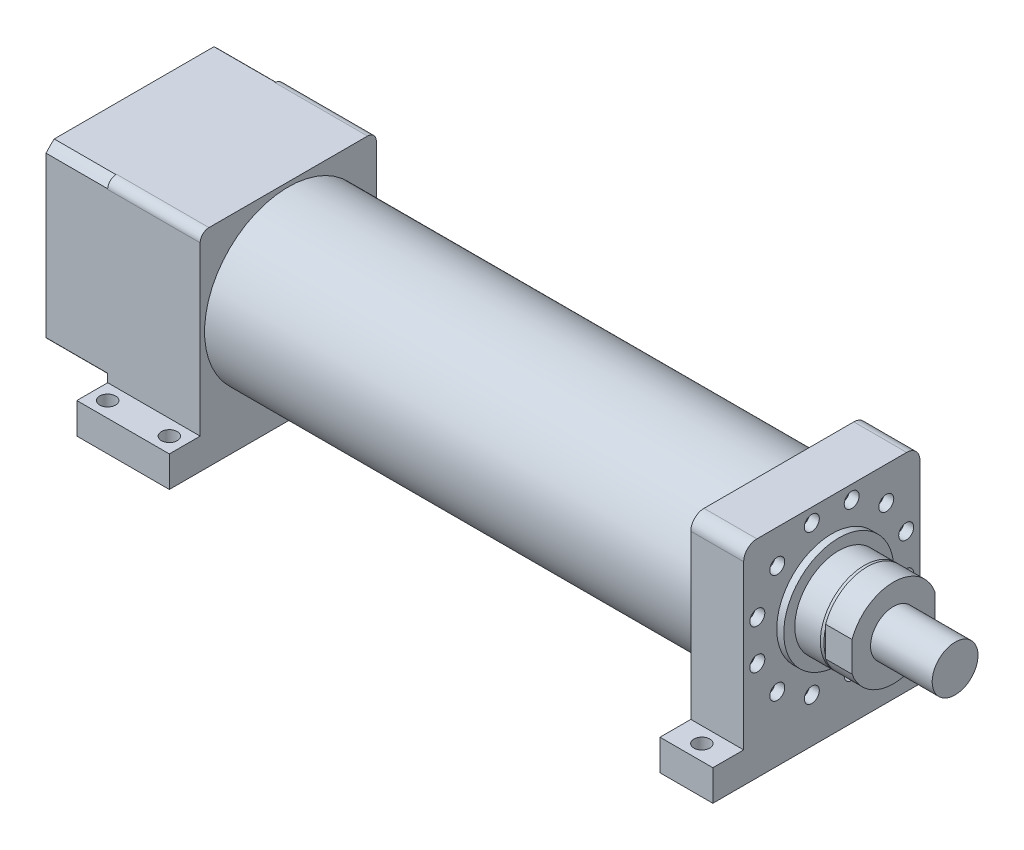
ISO-10303-21;
HEADER;
FILE_DESCRIPTION(('STEP AP214'),'2;1');
FILE_NAME('part.step','',(''),(''),'','','');
FILE_SCHEMA(('AUTOMOTIVE_DESIGN { 1 0 10303 214 1 1 1 1 }'));
ENDSEC;
DATA;
#1=APPLICATION_CONTEXT('core data for automotive mechanical design processes');
#2=APPLICATION_PROTOCOL_DEFINITION('international standard','automotive_design',2000,#1);
#3=PRODUCT_CONTEXT('',#1,'mechanical');
#4=PRODUCT('Part','Part','',(#3));
#5=PRODUCT_RELATED_PRODUCT_CATEGORY('part','',(#4));
#6=PRODUCT_DEFINITION_FORMATION('','',#4);
#7=PRODUCT_DEFINITION_CONTEXT('part definition',#1,'design');
#8=PRODUCT_DEFINITION('design','',#6,#7);
#9=PRODUCT_DEFINITION_SHAPE('','',#8);
#10=(LENGTH_UNIT() NAMED_UNIT(*) SI_UNIT(.MILLI.,.METRE.));
#11=(NAMED_UNIT(*) PLANE_ANGLE_UNIT() SI_UNIT($,.RADIAN.));
#12=(NAMED_UNIT(*) SI_UNIT($,.STERADIAN.) SOLID_ANGLE_UNIT());
#13=UNCERTAINTY_MEASURE_WITH_UNIT(LENGTH_MEASURE(1.E-05),#10,'distance_accuracy_value','');
#14=(GEOMETRIC_REPRESENTATION_CONTEXT(3) GLOBAL_UNCERTAINTY_ASSIGNED_CONTEXT((#13)) GLOBAL_UNIT_ASSIGNED_CONTEXT((#10,
#11,#12)) REPRESENTATION_CONTEXT('',''));
#15=CARTESIAN_POINT('',(0.,0.,0.));
#16=DIRECTION('',(0.,0.,1.));
#17=DIRECTION('',(1.,0.,0.));
#18=AXIS2_PLACEMENT_3D('',#15,#16,#17);
#19=CARTESIAN_POINT('',(757.,0.,0.));
#20=DIRECTION('',(-1.,0.,0.));
#21=DIRECTION('',(0.,0.,1.));
#22=AXIS2_PLACEMENT_3D('',#19,#20,#21);
#23=CYLINDRICAL_SURFACE('',#22,26.);
#24=CARTESIAN_POINT('',(757.,0.,0.));
#25=DIRECTION('',(1.,0.,0.));
#26=DIRECTION('',(0.,0.,-1.));
#27=AXIS2_PLACEMENT_3D('',#24,#25,#26);
#28=CIRCLE('',#27,26.);
#29=CARTESIAN_POINT('',(757.,0.,-26.));
#30=VERTEX_POINT('',#29);
#31=EDGE_CURVE('E11',#30,#30,#28,.T.);
#32=ORIENTED_EDGE('',*,*,#31,.F.);
#33=EDGE_LOOP('',(#32));
#34=FACE_BOUND('',#33,.T.);
#35=CARTESIAN_POINT('',(687.,0.,0.));
#36=DIRECTION('',(1.,0.,0.));
#37=DIRECTION('',(0.,0.,-1.));
#38=AXIS2_PLACEMENT_3D('',#35,#36,#37);
#39=CIRCLE('',#38,26.);
#40=CARTESIAN_POINT('',(687.,0.,-26.));
#41=VERTEX_POINT('',#40);
#42=EDGE_CURVE('E48',#41,#41,#39,.T.);
#43=ORIENTED_EDGE('',*,*,#42,.T.);
#44=EDGE_LOOP('',(#43));
#45=FACE_BOUND('',#44,.T.);
#46=ADVANCED_FACE('F45',(#34,#45),#23,.T.);
#47=CARTESIAN_POINT('',(757.,0.,0.));
#48=DIRECTION('',(1.,0.,0.));
#49=DIRECTION('',(0.,0.,-1.));
#50=AXIS2_PLACEMENT_3D('',#47,#48,#49);
#51=PLANE('',#50);
#52=ORIENTED_EDGE('',*,*,#31,.T.);
#53=EDGE_LOOP('',(#52));
#54=FACE_BOUND('',#53,.T.);
#55=ADVANCED_FACE('F60',(#54),#51,.T.);
#56=CARTESIAN_POINT('',(687.,0.,0.));
#57=DIRECTION('',(1.,0.,0.));
#58=DIRECTION('',(0.,0.,-1.));
#59=AXIS2_PLACEMENT_3D('',#56,#57,#58);
#60=PLANE('',#59);
#61=ORIENTED_EDGE('',*,*,#42,.F.);
#62=EDGE_LOOP('',(#61));
#63=FACE_BOUND('',#62,.T.);
#64=ADVANCED_FACE('F58',(#63),#60,.F.);
#65=CLOSED_SHELL('',(#46,#55,#64));
#66=MANIFOLD_SOLID_BREP('B2',#65);
#67=CARTESIAN_POINT('',(-105.,90.,-90.0000000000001));
#68=DIRECTION('',(1.,0.,0.));
#69=DIRECTION('',(0.,0.,-1.));
#70=AXIS2_PLACEMENT_3D('',#67,#68,#69);
#71=PLANE('',#70);
#72=CARTESIAN_POINT('',(-105.,0.,0.));
#73=DIRECTION('',(-1.,0.,0.));
#74=DIRECTION('',(0.,0.,1.));
#75=AXIS2_PLACEMENT_3D('',#72,#73,#74);
#76=CIRCLE('',#75,135.);
#77=CARTESIAN_POINT('',(-105.,99.9740153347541,-90.7204291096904));
#78=VERTEX_POINT('',#77);
#79=CARTESIAN_POINT('',(-105.,90.7204291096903,-99.9740153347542));
#80=VERTEX_POINT('',#79);
#81=EDGE_CURVE('E43',#78,#80,#76,.T.);
#82=ORIENTED_EDGE('',*,*,#81,.F.);
#83=CARTESIAN_POINT('',(-105.,90.,-90.0000000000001));
#84=DIRECTION('',(-1.,0.,0.));
#85=DIRECTION('',(0.,0.,-1.));
#86=AXIS2_PLACEMENT_3D('',#83,#84,#85);
#87=CIRCLE('',#86,9.99999999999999);
#88=EDGE_CURVE('E524',#78,#80,#87,.T.);
#89=ORIENTED_EDGE('',*,*,#88,.T.);
#90=EDGE_LOOP('',(#82,#89));
#91=FACE_BOUND('',#90,.T.);
#92=ADVANCED_FACE('F87',(#91),#71,.F.);
#93=CARTESIAN_POINT('',(-105.,0.,0.));
#94=DIRECTION('',(-1.,0.,0.));
#95=DIRECTION('',(0.,0.,1.));
#96=AXIS2_PLACEMENT_3D('',#93,#94,#95);
#97=CIRCLE('',#96,135.);
#98=CARTESIAN_POINT('',(-105.,90.7204291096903,99.9740153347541));
#99=VERTEX_POINT('',#98);
#100=CARTESIAN_POINT('',(-105.,99.9740153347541,90.7204291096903));
#101=VERTEX_POINT('',#100);
#102=EDGE_CURVE('E97',#99,#101,#97,.T.);
#103=ORIENTED_EDGE('',*,*,#102,.F.);
#104=CARTESIAN_POINT('',(-105.,90.,90.));
#105=DIRECTION('',(-1.,0.,0.));
#106=DIRECTION('',(0.,0.,1.));
#107=AXIS2_PLACEMENT_3D('',#104,#105,#106);
#108=CIRCLE('',#107,9.99999999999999);
#109=EDGE_CURVE('E519',#99,#101,#108,.T.);
#110=ORIENTED_EDGE('',*,*,#109,.T.);
#111=EDGE_LOOP('',(#103,#110));
#112=FACE_BOUND('',#111,.T.);
#113=ADVANCED_FACE('F778',(#112),#71,.F.);
#114=CARTESIAN_POINT('',(657.,0.,0.));
#115=DIRECTION('',(1.,0.,0.));
#116=DIRECTION('',(0.,0.,-1.));
#117=AXIS2_PLACEMENT_3D('',#114,#115,#116);
#118=PLANE('',#117);
#119=CARTESIAN_POINT('',(657.,0.,0.));
#120=DIRECTION('',(1.,0.,0.));
#121=DIRECTION('',(0.,0.,-1.));
#122=AXIS2_PLACEMENT_3D('',#119,#120,#121);
#123=CIRCLE('',#122,48.9080892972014);
#124=CARTESIAN_POINT('',(657.,-13.5277935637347,-47.));
#125=VERTEX_POINT('',#124);
#126=CARTESIAN_POINT('',(657.,13.5277935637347,-47.));
#127=VERTEX_POINT('',#126);
#128=EDGE_CURVE('E599',#125,#127,#123,.T.);
#129=ORIENTED_EDGE('',*,*,#128,.T.);
#130=DIRECTION('',(0.,-1.,0.));
#131=VECTOR('',#130,1.);
#132=CARTESIAN_POINT('',(657.,17.058722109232,-47.));
#133=LINE('',#132,#131);
#134=EDGE_CURVE('E576',#127,#125,#133,.T.);
#135=ORIENTED_EDGE('',*,*,#134,.T.);
#136=EDGE_LOOP('',(#129,#135));
#137=FACE_BOUND('',#136,.T.);
#138=ADVANCED_FACE('F785',(#137),#118,.T.);
#139=CARTESIAN_POINT('',(557.,0.,0.));
#140=DIRECTION('',(-1.,0.,0.));
#141=DIRECTION('',(0.,0.,1.));
#142=AXIS2_PLACEMENT_3D('',#139,#140,#141);
#143=CYLINDRICAL_SURFACE('',#142,95.);
#144=CARTESIAN_POINT('',(557.,0.,0.));
#145=DIRECTION('',(1.,0.,0.));
#146=DIRECTION('',(0.,0.,-1.));
#147=AXIS2_PLACEMENT_3D('',#144,#145,#146);
#148=CIRCLE('',#147,95.);
#149=CARTESIAN_POINT('',(557.,0.,-95.));
#150=VERTEX_POINT('',#149);
#151=EDGE_CURVE('E678',#150,#150,#148,.T.);
#152=ORIENTED_EDGE('',*,*,#151,.F.);
#153=EDGE_LOOP('',(#152));
#154=FACE_BOUND('',#153,.T.);
#155=CARTESIAN_POINT('',(0.,0.,0.));
#156=DIRECTION('',(1.,0.,0.));
#157=DIRECTION('',(0.,0.,-1.));
#158=AXIS2_PLACEMENT_3D('',#155,#156,#157);
#159=CIRCLE('',#158,95.);
#160=CARTESIAN_POINT('',(0.,0.,-95.));
#161=VERTEX_POINT('',#160);
#162=EDGE_CURVE('E553',#161,#161,#159,.T.);
#163=ORIENTED_EDGE('',*,*,#162,.T.);
#164=EDGE_LOOP('',(#163));
#165=FACE_BOUND('',#164,.T.);
#166=ADVANCED_FACE('F895',(#154,#165),#143,.T.);
#167=CARTESIAN_POINT('',(617.,84.9999999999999,-100.));
#168=DIRECTION('',(0.,0.,1.));
#169=DIRECTION('',(0.,-1.,0.));
#170=AXIS2_PLACEMENT_3D('',#167,#168,#169);
#171=PLANE('',#170);
#172=DIRECTION('',(0.,1.,0.));
#173=VECTOR('',#172,1.);
#174=CARTESIAN_POINT('',(557.,84.9999999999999,-100.));
#175=LINE('',#174,#173);
#176=CARTESIAN_POINT('',(557.,-100.,-100.));
#177=VERTEX_POINT('',#176);
#178=CARTESIAN_POINT('',(557.,84.9999999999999,-100.));
#179=VERTEX_POINT('',#178);
#180=EDGE_CURVE('E675',#177,#179,#175,.T.);
#181=ORIENTED_EDGE('',*,*,#180,.T.);
#182=DIRECTION('',(-1.,0.,0.));
#183=VECTOR('',#182,1.);
#184=CARTESIAN_POINT('',(617.,84.9999999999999,-100.));
#185=LINE('',#184,#183);
#186=CARTESIAN_POINT('',(617.,84.9999999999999,-100.));
#187=VERTEX_POINT('',#186);
#188=EDGE_CURVE('E714',#187,#179,#185,.T.);
#189=ORIENTED_EDGE('',*,*,#188,.F.);
#190=DIRECTION('',(0.,1.,0.));
#191=VECTOR('',#190,1.);
#192=CARTESIAN_POINT('',(617.,-100.,-100.));
#193=LINE('',#192,#191);
#194=CARTESIAN_POINT('',(617.,-100.,-100.));
#195=VERTEX_POINT('',#194);
#196=EDGE_CURVE('E679',#195,#187,#193,.T.);
#197=ORIENTED_EDGE('',*,*,#196,.F.);
#198=DIRECTION('',(-1.,0.,0.));
#199=VECTOR('',#198,1.);
#200=CARTESIAN_POINT('',(617.,-100.,-100.));
#201=LINE('',#200,#199);
#202=EDGE_CURVE('E690',#195,#177,#201,.T.);
#203=ORIENTED_EDGE('',*,*,#202,.T.);
#204=EDGE_LOOP('',(#181,#189,#197,#203));
#205=FACE_BOUND('',#204,.T.);
#206=ADVANCED_FACE('F891',(#205),#171,.F.);
#207=CARTESIAN_POINT('',(617.,85.,-85.));
#208=DIRECTION('',(-1.,0.,0.));
#209=DIRECTION('',(0.,0.,1.));
#210=AXIS2_PLACEMENT_3D('',#207,#208,#209);
#211=CYLINDRICAL_SURFACE('',#210,15.);
#212=CARTESIAN_POINT('',(557.,85.,-85.));
#213=DIRECTION('',(1.,0.,0.));
#214=DIRECTION('',(0.,0.,-1.));
#215=AXIS2_PLACEMENT_3D('',#212,#213,#214);
#216=CIRCLE('',#215,15.);
#217=CARTESIAN_POINT('',(557.,100.,-84.9999999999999));
#218=VERTEX_POINT('',#217);
#219=EDGE_CURVE('E692',#179,#218,#216,.T.);
#220=ORIENTED_EDGE('',*,*,#219,.T.);
#221=DIRECTION('',(-1.,0.,0.));
#222=VECTOR('',#221,1.);
#223=CARTESIAN_POINT('',(617.,100.,-84.9999999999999));
#224=LINE('',#223,#222);
#225=CARTESIAN_POINT('',(617.,100.,-84.9999999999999));
#226=VERTEX_POINT('',#225);
#227=EDGE_CURVE('E711',#226,#218,#224,.T.);
#228=ORIENTED_EDGE('',*,*,#227,.F.);
#229=CARTESIAN_POINT('',(617.,85.,-85.));
#230=DIRECTION('',(1.,0.,0.));
#231=DIRECTION('',(0.,0.,-1.));
#232=AXIS2_PLACEMENT_3D('',#229,#230,#231);
#233=CIRCLE('',#232,15.);
#234=EDGE_CURVE('E681',#187,#226,#233,.T.);
#235=ORIENTED_EDGE('',*,*,#234,.F.);
#236=ORIENTED_EDGE('',*,*,#188,.T.);
#237=EDGE_LOOP('',(#220,#228,#235,#236));
#238=FACE_BOUND('',#237,.T.);
#239=ADVANCED_FACE('F887',(#238),#211,.T.);
#240=CARTESIAN_POINT('',(617.,100.,84.9999999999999));
#241=DIRECTION('',(0.,-1.,0.));
#242=DIRECTION('',(0.,0.,-1.));
#243=AXIS2_PLACEMENT_3D('',#240,#241,#242);
#244=PLANE('',#243);
#245=DIRECTION('',(0.,0.,1.));
#246=VECTOR('',#245,1.);
#247=CARTESIAN_POINT('',(557.,100.,84.9999999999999));
#248=LINE('',#247,#246);
#249=CARTESIAN_POINT('',(557.,100.,84.9999999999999));
#250=VERTEX_POINT('',#249);
#251=EDGE_CURVE('E694',#218,#250,#248,.T.);
#252=ORIENTED_EDGE('',*,*,#251,.T.);
#253=DIRECTION('',(-1.,0.,0.));
#254=VECTOR('',#253,1.);
#255=CARTESIAN_POINT('',(617.,100.,84.9999999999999));
#256=LINE('',#255,#254);
#257=CARTESIAN_POINT('',(617.,100.,84.9999999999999));
#258=VERTEX_POINT('',#257);
#259=EDGE_CURVE('E708',#258,#250,#256,.T.);
#260=ORIENTED_EDGE('',*,*,#259,.F.);
#261=DIRECTION('',(0.,0.,1.));
#262=VECTOR('',#261,1.);
#263=CARTESIAN_POINT('',(617.,100.,84.9999999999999));
#264=LINE('',#263,#262);
#265=EDGE_CURVE('E684',#226,#258,#264,.T.);
#266=ORIENTED_EDGE('',*,*,#265,.F.);
#267=ORIENTED_EDGE('',*,*,#227,.T.);
#268=EDGE_LOOP('',(#252,#260,#266,#267));
#269=FACE_BOUND('',#268,.T.);
#270=ADVANCED_FACE('F883',(#269),#244,.F.);
#271=CARTESIAN_POINT('',(617.,85.,85.));
#272=DIRECTION('',(-1.,0.,0.));
#273=DIRECTION('',(0.,0.,1.));
#274=AXIS2_PLACEMENT_3D('',#271,#272,#273);
#275=CYLINDRICAL_SURFACE('',#274,15.);
#276=CARTESIAN_POINT('',(557.,85.,85.));
#277=DIRECTION('',(1.,0.,0.));
#278=DIRECTION('',(0.,0.,1.));
#279=AXIS2_PLACEMENT_3D('',#276,#277,#278);
#280=CIRCLE('',#279,15.);
#281=CARTESIAN_POINT('',(557.,84.9999999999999,100.));
#282=VERTEX_POINT('',#281);
#283=EDGE_CURVE('E696',#250,#282,#280,.T.);
#284=ORIENTED_EDGE('',*,*,#283,.T.);
#285=DIRECTION('',(-1.,0.,0.));
#286=VECTOR('',#285,1.);
#287=CARTESIAN_POINT('',(617.,84.9999999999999,100.));
#288=LINE('',#287,#286);
#289=CARTESIAN_POINT('',(617.,84.9999999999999,100.));
#290=VERTEX_POINT('',#289);
#291=EDGE_CURVE('E705',#290,#282,#288,.T.);
#292=ORIENTED_EDGE('',*,*,#291,.F.);
#293=CARTESIAN_POINT('',(617.,85.,85.));
#294=DIRECTION('',(1.,0.,0.));
#295=DIRECTION('',(0.,0.,1.));
#296=AXIS2_PLACEMENT_3D('',#293,#294,#295);
#297=CIRCLE('',#296,15.);
#298=EDGE_CURVE('E686',#258,#290,#297,.T.);
#299=ORIENTED_EDGE('',*,*,#298,.F.);
#300=ORIENTED_EDGE('',*,*,#259,.T.);
#301=EDGE_LOOP('',(#284,#292,#299,#300));
#302=FACE_BOUND('',#301,.T.);
#303=ADVANCED_FACE('F875',(#302),#275,.T.);
#304=CARTESIAN_POINT('',(617.,-84.9999999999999,100.));
#305=DIRECTION('',(0.,0.,-1.));
#306=DIRECTION('',(-1.,0.,0.));
#307=AXIS2_PLACEMENT_3D('',#304,#305,#306);
#308=PLANE('',#307);
#309=DIRECTION('',(0.,-1.,0.));
#310=VECTOR('',#309,1.);
#311=CARTESIAN_POINT('',(557.,-84.9999999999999,100.));
#312=LINE('',#311,#310);
#313=CARTESIAN_POINT('',(557.,-100.,100.));
#314=VERTEX_POINT('',#313);
#315=EDGE_CURVE('E682',#282,#314,#312,.T.);
#316=ORIENTED_EDGE('',*,*,#315,.T.);
#317=DIRECTION('',(-1.,0.,0.));
#318=VECTOR('',#317,1.);
#319=CARTESIAN_POINT('',(617.,-100.,100.));
#320=LINE('',#319,#318);
#321=CARTESIAN_POINT('',(617.,-100.,100.));
#322=VERTEX_POINT('',#321);
#323=EDGE_CURVE('E702',#322,#314,#320,.T.);
#324=ORIENTED_EDGE('',*,*,#323,.F.);
#325=DIRECTION('',(0.,-1.,0.));
#326=VECTOR('',#325,1.);
#327=CARTESIAN_POINT('',(617.,84.9999999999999,100.));
#328=LINE('',#327,#326);
#329=EDGE_CURVE('E688',#290,#322,#328,.T.);
#330=ORIENTED_EDGE('',*,*,#329,.F.);
#331=ORIENTED_EDGE('',*,*,#291,.T.);
#332=EDGE_LOOP('',(#316,#324,#330,#331));
#333=FACE_BOUND('',#332,.T.);
#334=ADVANCED_FACE('F865',(#333),#308,.F.);
#335=CARTESIAN_POINT('',(617.,85.,-85.));
#336=DIRECTION('',(1.,0.,0.));
#337=DIRECTION('',(0.,0.,-1.));
#338=AXIS2_PLACEMENT_3D('',#335,#336,#337);
#339=PLANE('',#338);
#340=CARTESIAN_POINT('',(617.,61.8718433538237,61.8718433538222));
#341=DIRECTION('',(1.,0.,0.));
#342=DIRECTION('',(0.,0.,-1.));
#343=AXIS2_PLACEMENT_3D('',#340,#341,#342);
#344=CIRCLE('',#343,8.50000000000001);
#345=CARTESIAN_POINT('',(617.,61.8718433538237,53.3718433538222));
#346=VERTEX_POINT('',#345);
#347=EDGE_CURVE('E619',#346,#346,#344,.T.);
#348=ORIENTED_EDGE('',*,*,#347,.F.);
#349=EDGE_LOOP('',(#348));
#350=FACE_BOUND('',#349,.T.);
#351=CARTESIAN_POINT('',(617.,22.6466664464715,84.5185098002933));
#352=DIRECTION('',(1.,0.,0.));
#353=DIRECTION('',(0.,0.,-1.));
#354=AXIS2_PLACEMENT_3D('',#351,#352,#353);
#355=CIRCLE('',#354,8.5);
#356=CARTESIAN_POINT('',(617.,22.6466664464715,76.0185098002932));
#357=VERTEX_POINT('',#356);
#358=EDGE_CURVE('E626',#357,#357,#355,.T.);
#359=ORIENTED_EDGE('',*,*,#358,.F.);
#360=EDGE_LOOP('',(#359));
#361=FACE_BOUND('',#360,.T.);
#362=CARTESIAN_POINT('',(617.,-22.6466664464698,84.5185098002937));
#363=DIRECTION('',(1.,0.,0.));
#364=DIRECTION('',(0.,0.,-1.));
#365=AXIS2_PLACEMENT_3D('',#362,#363,#364);
#366=CIRCLE('',#365,8.5);
#367=CARTESIAN_POINT('',(617.,-22.6466664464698,76.0185098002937));
#368=VERTEX_POINT('',#367);
#369=EDGE_CURVE('E632',#368,#368,#366,.T.);
#370=ORIENTED_EDGE('',*,*,#369,.F.);
#371=EDGE_LOOP('',(#370));
#372=FACE_BOUND('',#371,.T.);
#373=CARTESIAN_POINT('',(617.,-61.8718433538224,61.8718433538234));
#374=DIRECTION('',(1.,0.,0.));
#375=DIRECTION('',(0.,0.,-1.));
#376=AXIS2_PLACEMENT_3D('',#373,#374,#375);
#377=CIRCLE('',#376,8.5);
#378=CARTESIAN_POINT('',(617.,-61.8718433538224,53.3718433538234));
#379=VERTEX_POINT('',#378);
#380=EDGE_CURVE('E638',#379,#379,#377,.T.);
#381=ORIENTED_EDGE('',*,*,#380,.F.);
#382=EDGE_LOOP('',(#381));
#383=FACE_BOUND('',#382,.T.);
#384=CARTESIAN_POINT('',(617.,-84.5185098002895,22.6466664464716));
#385=DIRECTION('',(1.,0.,0.));
#386=DIRECTION('',(0.,0.,-1.));
#387=AXIS2_PLACEMENT_3D('',#384,#385,#386);
#388=CIRCLE('',#387,8.49999999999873);
#389=CARTESIAN_POINT('',(617.,-84.5185098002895,14.1466664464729));
#390=VERTEX_POINT('',#389);
#391=EDGE_CURVE('E644',#390,#390,#388,.T.);
#392=ORIENTED_EDGE('',*,*,#391,.F.);
#393=EDGE_LOOP('',(#392));
#394=FACE_BOUND('',#393,.T.);
#395=CARTESIAN_POINT('',(617.,-84.5185098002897,-22.6466664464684));
#396=DIRECTION('',(1.,0.,0.));
#397=DIRECTION('',(0.,0.,-1.));
#398=AXIS2_PLACEMENT_3D('',#395,#396,#397);
#399=CIRCLE('',#398,8.49999999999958);
#400=CARTESIAN_POINT('',(617.,-84.5185098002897,-31.146666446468));
#401=VERTEX_POINT('',#400);
#402=EDGE_CURVE('E650',#401,#401,#399,.T.);
#403=ORIENTED_EDGE('',*,*,#402,.F.);
#404=EDGE_LOOP('',(#403));
#405=FACE_BOUND('',#404,.T.);
#406=CARTESIAN_POINT('',(617.,-61.8718433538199,-61.87184335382));
#407=DIRECTION('',(1.,0.,0.));
#408=DIRECTION('',(0.,0.,-1.));
#409=AXIS2_PLACEMENT_3D('',#406,#407,#408);
#410=CIRCLE('',#409,8.50000000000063);
#411=CARTESIAN_POINT('',(617.,-61.8718433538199,-70.3718433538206));
#412=VERTEX_POINT('',#411);
#413=EDGE_CURVE('E656',#412,#412,#410,.T.);
#414=ORIENTED_EDGE('',*,*,#413,.F.);
#415=EDGE_LOOP('',(#414));
#416=FACE_BOUND('',#415,.T.);
#417=CARTESIAN_POINT('',(617.,-22.6466664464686,-84.5185098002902));
#418=DIRECTION('',(1.,0.,0.));
#419=DIRECTION('',(0.,0.,-1.));
#420=AXIS2_PLACEMENT_3D('',#417,#418,#419);
#421=CIRCLE('',#420,8.5000000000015);
#422=CARTESIAN_POINT('',(617.,-22.6466664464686,-93.0185098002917));
#423=VERTEX_POINT('',#422);
#424=EDGE_CURVE('E662',#423,#423,#421,.T.);
#425=ORIENTED_EDGE('',*,*,#424,.F.);
#426=EDGE_LOOP('',(#425));
#427=FACE_BOUND('',#426,.T.);
#428=CARTESIAN_POINT('',(617.,22.6466664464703,-84.5185098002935));
#429=DIRECTION('',(1.,0.,0.));
#430=DIRECTION('',(0.,0.,-1.));
#431=AXIS2_PLACEMENT_3D('',#428,#429,#430);
#432=CIRCLE('',#431,8.5);
#433=CARTESIAN_POINT('',(617.,22.6466664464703,-93.0185098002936));
#434=VERTEX_POINT('',#433);
#435=EDGE_CURVE('E601',#434,#434,#432,.T.);
#436=ORIENTED_EDGE('',*,*,#435,.F.);
#437=EDGE_LOOP('',(#436));
#438=FACE_BOUND('',#437,.T.);
#439=CARTESIAN_POINT('',(617.,61.8718433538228,-61.871843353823));
#440=DIRECTION('',(1.,0.,0.));
#441=DIRECTION('',(0.,0.,-1.));
#442=AXIS2_PLACEMENT_3D('',#439,#440,#441);
#443=CIRCLE('',#442,8.50000000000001);
#444=CARTESIAN_POINT('',(617.,61.8718433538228,-70.371843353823));
#445=VERTEX_POINT('',#444);
#446=EDGE_CURVE('E608',#445,#445,#443,.T.);
#447=ORIENTED_EDGE('',*,*,#446,.F.);
#448=EDGE_LOOP('',(#447));
#449=FACE_BOUND('',#448,.T.);
#450=CARTESIAN_POINT('',(617.,84.5185098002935,-22.6466664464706));
#451=DIRECTION('',(1.,0.,0.));
#452=DIRECTION('',(0.,0.,-1.));
#453=AXIS2_PLACEMENT_3D('',#450,#451,#452);
#454=CIRCLE('',#453,8.50000000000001);
#455=CARTESIAN_POINT('',(617.,84.5185098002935,-31.1466664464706));
#456=VERTEX_POINT('',#455);
#457=EDGE_CURVE('E614',#456,#456,#454,.T.);
#458=ORIENTED_EDGE('',*,*,#457,.F.);
#459=EDGE_LOOP('',(#458));
#460=FACE_BOUND('',#459,.T.);
#461=CARTESIAN_POINT('',(617.,84.5185098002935,22.6466664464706));
#462=DIRECTION('',(1.,0.,0.));
#463=DIRECTION('',(0.,0.,-1.));
#464=AXIS2_PLACEMENT_3D('',#461,#462,#463);
#465=CIRCLE('',#464,8.5);
#466=CARTESIAN_POINT('',(617.,84.5185098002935,14.1466664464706));
#467=VERTEX_POINT('',#466);
#468=EDGE_CURVE('E622',#467,#467,#465,.T.);
#469=ORIENTED_EDGE('',*,*,#468,.F.);
#470=EDGE_LOOP('',(#469));
#471=FACE_BOUND('',#470,.T.);
#472=CARTESIAN_POINT('',(617.,0.,0.));
#473=DIRECTION('',(1.,0.,0.));
#474=DIRECTION('',(0.,0.,-1.));
#475=AXIS2_PLACEMENT_3D('',#472,#473,#474);
#476=CIRCLE('',#475,62.5);
#477=CARTESIAN_POINT('',(617.,0.,-62.5));
#478=VERTEX_POINT('',#477);
#479=EDGE_CURVE('E600',#478,#478,#476,.T.);
#480=ORIENTED_EDGE('',*,*,#479,.F.);
#481=EDGE_LOOP('',(#480));
#482=FACE_BOUND('',#481,.T.);
#483=ORIENTED_EDGE('',*,*,#196,.T.);
#484=ORIENTED_EDGE('',*,*,#234,.T.);
#485=ORIENTED_EDGE('',*,*,#265,.T.);
#486=ORIENTED_EDGE('',*,*,#298,.T.);
#487=ORIENTED_EDGE('',*,*,#329,.T.);
#488=DIRECTION('',(0.,0.,1.));
#489=VECTOR('',#488,1.);
#490=CARTESIAN_POINT('',(617.,-100.,135.));
#491=LINE('',#490,#489);
#492=CARTESIAN_POINT('',(617.,-100.,135.));
#493=VERTEX_POINT('',#492);
#494=EDGE_CURVE('E350',#322,#493,#491,.T.);
#495=ORIENTED_EDGE('',*,*,#494,.T.);
#496=DIRECTION('',(0.,1.,0.));
#497=VECTOR('',#496,1.);
#498=CARTESIAN_POINT('',(617.,-135.,135.));
#499=LINE('',#498,#497);
#500=CARTESIAN_POINT('',(617.,-135.,135.));
#501=VERTEX_POINT('',#500);
#502=EDGE_CURVE('E330',#501,#493,#499,.T.);
#503=ORIENTED_EDGE('',*,*,#502,.F.);
#504=DIRECTION('',(0.,0.,1.));
#505=VECTOR('',#504,1.);
#506=CARTESIAN_POINT('',(617.,-135.,135.));
#507=LINE('',#506,#505);
#508=CARTESIAN_POINT('',(617.,-135.,-135.));
#509=VERTEX_POINT('',#508);
#510=EDGE_CURVE('E336',#509,#501,#507,.T.);
#511=ORIENTED_EDGE('',*,*,#510,.F.);
#512=DIRECTION('',(0.,1.,0.));
#513=VECTOR('',#512,1.);
#514=CARTESIAN_POINT('',(617.,-135.,-135.));
#515=LINE('',#514,#513);
#516=CARTESIAN_POINT('',(617.,-100.,-135.));
#517=VERTEX_POINT('',#516);
#518=EDGE_CURVE('E1881',#509,#517,#515,.T.);
#519=ORIENTED_EDGE('',*,*,#518,.T.);
#520=EDGE_CURVE('E1882',#517,#195,#491,.T.);
#521=ORIENTED_EDGE('',*,*,#520,.T.);
#522=EDGE_LOOP('',(#483,#484,#485,#486,#487,#495,#503,#511,#519,#521));
#523=FACE_BOUND('',#522,.T.);
#524=ADVANCED_FACE('F348',(#350,#361,#372,#383,#394,#405,#416,#427,#438,#449,#460,#471,#482,
#523),#339,.T.);
#525=CARTESIAN_POINT('',(557.,85.,-85.));
#526=DIRECTION('',(1.,0.,0.));
#527=DIRECTION('',(0.,0.,-1.));
#528=AXIS2_PLACEMENT_3D('',#525,#526,#527);
#529=PLANE('',#528);
#530=ORIENTED_EDGE('',*,*,#151,.T.);
#531=EDGE_LOOP('',(#530));
#532=FACE_BOUND('',#531,.T.);
#533=ORIENTED_EDGE('',*,*,#180,.F.);
#534=DIRECTION('',(0.,0.,-1.));
#535=VECTOR('',#534,1.);
#536=CARTESIAN_POINT('',(557.,-100.,135.));
#537=LINE('',#536,#535);
#538=CARTESIAN_POINT('',(557.,-100.,-135.));
#539=VERTEX_POINT('',#538);
#540=EDGE_CURVE('E1887',#177,#539,#537,.T.);
#541=ORIENTED_EDGE('',*,*,#540,.T.);
#542=DIRECTION('',(0.,1.,0.));
#543=VECTOR('',#542,1.);
#544=CARTESIAN_POINT('',(557.,-135.,-135.));
#545=LINE('',#544,#543);
#546=CARTESIAN_POINT('',(557.,-135.,-135.));
#547=VERTEX_POINT('',#546);
#548=EDGE_CURVE('E357',#547,#539,#545,.T.);
#549=ORIENTED_EDGE('',*,*,#548,.F.);
#550=DIRECTION('',(0.,0.,-1.));
#551=VECTOR('',#550,1.);
#552=CARTESIAN_POINT('',(557.,-135.,135.));
#553=LINE('',#552,#551);
#554=CARTESIAN_POINT('',(557.,-135.,135.));
#555=VERTEX_POINT('',#554);
#556=EDGE_CURVE('E335',#555,#547,#553,.T.);
#557=ORIENTED_EDGE('',*,*,#556,.F.);
#558=DIRECTION('',(0.,1.,0.));
#559=VECTOR('',#558,1.);
#560=CARTESIAN_POINT('',(557.,-135.,135.));
#561=LINE('',#560,#559);
#562=CARTESIAN_POINT('',(557.,-100.,135.));
#563=VERTEX_POINT('',#562);
#564=EDGE_CURVE('E332',#555,#563,#561,.T.);
#565=ORIENTED_EDGE('',*,*,#564,.T.);
#566=EDGE_CURVE('E1888',#563,#314,#537,.T.);
#567=ORIENTED_EDGE('',*,*,#566,.T.);
#568=ORIENTED_EDGE('',*,*,#315,.F.);
#569=ORIENTED_EDGE('',*,*,#283,.F.);
#570=ORIENTED_EDGE('',*,*,#251,.F.);
#571=ORIENTED_EDGE('',*,*,#219,.F.);
#572=EDGE_LOOP('',(#533,#541,#549,#557,#565,#567,#568,#569,#570,#571));
#573=FACE_BOUND('',#572,.T.);
#574=ADVANCED_FACE('F860',(#532,#573),#529,.F.);
#575=CARTESIAN_POINT('',(625.,0.,0.));
#576=DIRECTION('',(-1.,0.,0.));
#577=DIRECTION('',(0.,0.,1.));
#578=AXIS2_PLACEMENT_3D('',#575,#576,#577);
#579=CYLINDRICAL_SURFACE('',#578,62.5);
#580=CARTESIAN_POINT('',(625.,0.,0.));
#581=DIRECTION('',(1.,0.,0.));
#582=DIRECTION('',(0.,0.,-1.));
#583=AXIS2_PLACEMENT_3D('',#580,#581,#582);
#584=CIRCLE('',#583,62.5);
#585=CARTESIAN_POINT('',(625.,0.,-62.5));
#586=VERTEX_POINT('',#585);
#587=EDGE_CURVE('E670',#586,#586,#584,.T.);
#588=ORIENTED_EDGE('',*,*,#587,.F.);
#589=EDGE_LOOP('',(#588));
#590=FACE_BOUND('',#589,.T.);
#591=ORIENTED_EDGE('',*,*,#479,.T.);
#592=EDGE_LOOP('',(#591));
#593=FACE_BOUND('',#592,.T.);
#594=ADVANCED_FACE('F854',(#590,#593),#579,.T.);
#595=CARTESIAN_POINT('',(625.,0.,0.));
#596=DIRECTION('',(1.,0.,0.));
#597=DIRECTION('',(0.,0.,-1.));
#598=AXIS2_PLACEMENT_3D('',#595,#596,#597);
#599=PLANE('',#598);
#600=CARTESIAN_POINT('',(625.,0.,0.));
#601=DIRECTION('',(1.,0.,0.));
#602=DIRECTION('',(0.,0.,-1.));
#603=AXIS2_PLACEMENT_3D('',#600,#601,#602);
#604=CIRCLE('',#603,50.);
#605=CARTESIAN_POINT('',(625.,0.,-50.));
#606=VERTEX_POINT('',#605);
#607=EDGE_CURVE('E596',#606,#606,#604,.T.);
#608=ORIENTED_EDGE('',*,*,#607,.F.);
#609=EDGE_LOOP('',(#608));
#610=FACE_BOUND('',#609,.T.);
#611=ORIENTED_EDGE('',*,*,#587,.T.);
#612=EDGE_LOOP('',(#611));
#613=FACE_BOUND('',#612,.T.);
#614=ADVANCED_FACE('F850',(#610,#613),#599,.T.);
#615=CARTESIAN_POINT('',(606.,84.5185098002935,22.6466664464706));
#616=DIRECTION('',(1.,0.,0.));
#617=DIRECTION('',(0.,0.,-1.));
#618=AXIS2_PLACEMENT_3D('',#615,#616,#617);
#619=CYLINDRICAL_SURFACE('',#618,8.5);
#620=CARTESIAN_POINT('',(606.,84.5185098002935,22.6466664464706));
#621=DIRECTION('',(1.,0.,0.));
#622=DIRECTION('',(0.,0.,-1.));
#623=AXIS2_PLACEMENT_3D('',#620,#621,#622);
#624=CIRCLE('',#623,8.5);
#625=CARTESIAN_POINT('',(606.,84.5185098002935,14.1466664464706));
#626=VERTEX_POINT('',#625);
#627=EDGE_CURVE('E667',#626,#626,#624,.T.);
#628=ORIENTED_EDGE('',*,*,#627,.F.);
#629=EDGE_LOOP('',(#628));
#630=FACE_BOUND('',#629,.T.);
#631=ORIENTED_EDGE('',*,*,#468,.T.);
#632=EDGE_LOOP('',(#631));
#633=FACE_BOUND('',#632,.T.);
#634=ADVANCED_FACE('F853',(#630,#633),#619,.F.);
#635=CARTESIAN_POINT('',(606.,84.5185098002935,22.6466664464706));
#636=DIRECTION('',(1.,0.,0.));
#637=DIRECTION('',(0.,0.,-1.));
#638=AXIS2_PLACEMENT_3D('',#635,#636,#637);
#639=PLANE('',#638);
#640=ORIENTED_EDGE('',*,*,#627,.T.);
#641=EDGE_LOOP('',(#640));
#642=FACE_BOUND('',#641,.T.);
#643=ADVANCED_FACE('F1385',(#642),#639,.T.);
#644=CARTESIAN_POINT('',(606.,84.5185098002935,-22.6466664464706));
#645=DIRECTION('',(1.,0.,0.));
#646=DIRECTION('',(0.,0.,-1.));
#647=AXIS2_PLACEMENT_3D('',#644,#645,#646);
#648=CYLINDRICAL_SURFACE('',#647,8.50000000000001);
#649=CARTESIAN_POINT('',(606.,84.5185098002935,-22.6466664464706));
#650=DIRECTION('',(1.,0.,0.));
#651=DIRECTION('',(0.,0.,-1.));
#652=AXIS2_PLACEMENT_3D('',#649,#650,#651);
#653=CIRCLE('',#652,8.50000000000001);
#654=CARTESIAN_POINT('',(606.,84.5185098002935,-31.1466664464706));
#655=VERTEX_POINT('',#654);
#656=EDGE_CURVE('E587',#655,#655,#653,.T.);
#657=ORIENTED_EDGE('',*,*,#656,.F.);
#658=EDGE_LOOP('',(#657));
#659=FACE_BOUND('',#658,.T.);
#660=ORIENTED_EDGE('',*,*,#457,.T.);
#661=EDGE_LOOP('',(#660));
#662=FACE_BOUND('',#661,.T.);
#663=ADVANCED_FACE('F1394',(#659,#662),#648,.F.);
#664=CARTESIAN_POINT('',(606.,84.5185098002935,-22.6466664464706));
#665=DIRECTION('',(1.,0.,0.));
#666=DIRECTION('',(0.,0.,-1.));
#667=AXIS2_PLACEMENT_3D('',#664,#665,#666);
#668=PLANE('',#667);
#669=ORIENTED_EDGE('',*,*,#656,.T.);
#670=EDGE_LOOP('',(#669));
#671=FACE_BOUND('',#670,.T.);
#672=ADVANCED_FACE('F1403',(#671),#668,.T.);
#673=CARTESIAN_POINT('',(606.,61.8718433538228,-61.871843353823));
#674=DIRECTION('',(1.,0.,0.));
#675=DIRECTION('',(0.,0.,-1.));
#676=AXIS2_PLACEMENT_3D('',#673,#674,#675);
#677=CYLINDRICAL_SURFACE('',#676,8.50000000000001);
#678=CARTESIAN_POINT('',(606.,61.8718433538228,-61.871843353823));
#679=DIRECTION('',(1.,0.,0.));
#680=DIRECTION('',(0.,0.,-1.));
#681=AXIS2_PLACEMENT_3D('',#678,#679,#680);
#682=CIRCLE('',#681,8.50000000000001);
#683=CARTESIAN_POINT('',(606.,61.8718433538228,-70.371843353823));
#684=VERTEX_POINT('',#683);
#685=EDGE_CURVE('E611',#684,#684,#682,.T.);
#686=ORIENTED_EDGE('',*,*,#685,.F.);
#687=EDGE_LOOP('',(#686));
#688=FACE_BOUND('',#687,.T.);
#689=ORIENTED_EDGE('',*,*,#446,.T.);
#690=EDGE_LOOP('',(#689));
#691=FACE_BOUND('',#690,.T.);
#692=ADVANCED_FACE('F1412',(#688,#691),#677,.F.);
#693=CARTESIAN_POINT('',(606.,61.8718433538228,-61.871843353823));
#694=DIRECTION('',(1.,0.,0.));
#695=DIRECTION('',(0.,0.,-1.));
#696=AXIS2_PLACEMENT_3D('',#693,#694,#695);
#697=PLANE('',#696);
#698=ORIENTED_EDGE('',*,*,#685,.T.);
#699=EDGE_LOOP('',(#698));
#700=FACE_BOUND('',#699,.T.);
#701=ADVANCED_FACE('F1421',(#700),#697,.T.);
#702=CARTESIAN_POINT('',(606.,22.6466664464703,-84.5185098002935));
#703=DIRECTION('',(1.,0.,0.));
#704=DIRECTION('',(0.,0.,-1.));
#705=AXIS2_PLACEMENT_3D('',#702,#703,#704);
#706=CYLINDRICAL_SURFACE('',#705,8.5);
#707=CARTESIAN_POINT('',(606.,22.6466664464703,-84.5185098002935));
#708=DIRECTION('',(1.,0.,0.));
#709=DIRECTION('',(0.,0.,-1.));
#710=AXIS2_PLACEMENT_3D('',#707,#708,#709);
#711=CIRCLE('',#710,8.5);
#712=CARTESIAN_POINT('',(606.,22.6466664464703,-93.0185098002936));
#713=VERTEX_POINT('',#712);
#714=EDGE_CURVE('E605',#713,#713,#711,.T.);
#715=ORIENTED_EDGE('',*,*,#714,.F.);
#716=EDGE_LOOP('',(#715));
#717=FACE_BOUND('',#716,.T.);
#718=ORIENTED_EDGE('',*,*,#435,.T.);
#719=EDGE_LOOP('',(#718));
#720=FACE_BOUND('',#719,.T.);
#721=ADVANCED_FACE('F1430',(#717,#720),#706,.F.);
#722=CARTESIAN_POINT('',(606.,22.6466664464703,-84.5185098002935));
#723=DIRECTION('',(1.,0.,0.));
#724=DIRECTION('',(0.,0.,-1.));
#725=AXIS2_PLACEMENT_3D('',#722,#723,#724);
#726=PLANE('',#725);
#727=ORIENTED_EDGE('',*,*,#714,.T.);
#728=EDGE_LOOP('',(#727));
#729=FACE_BOUND('',#728,.T.);
#730=ADVANCED_FACE('F1439',(#729),#726,.T.);
#731=CARTESIAN_POINT('',(606.,-22.6466664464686,-84.5185098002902));
#732=DIRECTION('',(1.,0.,0.));
#733=DIRECTION('',(0.,0.,-1.));
#734=AXIS2_PLACEMENT_3D('',#731,#732,#733);
#735=CYLINDRICAL_SURFACE('',#734,8.5000000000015);
#736=CARTESIAN_POINT('',(606.,-22.6466664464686,-84.5185098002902));
#737=DIRECTION('',(1.,0.,0.));
#738=DIRECTION('',(0.,0.,-1.));
#739=AXIS2_PLACEMENT_3D('',#736,#737,#738);
#740=CIRCLE('',#739,8.5000000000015);
#741=CARTESIAN_POINT('',(606.,-22.6466664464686,-93.0185098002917));
#742=VERTEX_POINT('',#741);
#743=EDGE_CURVE('E604',#742,#742,#740,.T.);
#744=ORIENTED_EDGE('',*,*,#743,.F.);
#745=EDGE_LOOP('',(#744));
#746=FACE_BOUND('',#745,.T.);
#747=ORIENTED_EDGE('',*,*,#424,.T.);
#748=EDGE_LOOP('',(#747));
#749=FACE_BOUND('',#748,.T.);
#750=ADVANCED_FACE('F1448',(#746,#749),#735,.F.);
#751=CARTESIAN_POINT('',(606.,-22.6466664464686,-84.5185098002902));
#752=DIRECTION('',(1.,0.,0.));
#753=DIRECTION('',(0.,0.,-1.));
#754=AXIS2_PLACEMENT_3D('',#751,#752,#753);
#755=PLANE('',#754);
#756=ORIENTED_EDGE('',*,*,#743,.T.);
#757=EDGE_LOOP('',(#756));
#758=FACE_BOUND('',#757,.T.);
#759=ADVANCED_FACE('F1457',(#758),#755,.T.);
#760=CARTESIAN_POINT('',(606.,-61.8718433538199,-61.87184335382));
#761=DIRECTION('',(1.,0.,0.));
#762=DIRECTION('',(0.,0.,-1.));
#763=AXIS2_PLACEMENT_3D('',#760,#761,#762);
#764=CYLINDRICAL_SURFACE('',#763,8.50000000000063);
#765=CARTESIAN_POINT('',(606.,-61.8718433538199,-61.87184335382));
#766=DIRECTION('',(1.,0.,0.));
#767=DIRECTION('',(0.,0.,-1.));
#768=AXIS2_PLACEMENT_3D('',#765,#766,#767);
#769=CIRCLE('',#768,8.50000000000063);
#770=CARTESIAN_POINT('',(606.,-61.8718433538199,-70.3718433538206));
#771=VERTEX_POINT('',#770);
#772=EDGE_CURVE('E659',#771,#771,#769,.T.);
#773=ORIENTED_EDGE('',*,*,#772,.F.);
#774=EDGE_LOOP('',(#773));
#775=FACE_BOUND('',#774,.T.);
#776=ORIENTED_EDGE('',*,*,#413,.T.);
#777=EDGE_LOOP('',(#776));
#778=FACE_BOUND('',#777,.T.);
#779=ADVANCED_FACE('F1466',(#775,#778),#764,.F.);
#780=CARTESIAN_POINT('',(606.,-61.8718433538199,-61.87184335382));
#781=DIRECTION('',(1.,0.,0.));
#782=DIRECTION('',(0.,0.,-1.));
#783=AXIS2_PLACEMENT_3D('',#780,#781,#782);
#784=PLANE('',#783);
#785=ORIENTED_EDGE('',*,*,#772,.T.);
#786=EDGE_LOOP('',(#785));
#787=FACE_BOUND('',#786,.T.);
#788=ADVANCED_FACE('F1475',(#787),#784,.T.);
#789=CARTESIAN_POINT('',(606.,-84.5185098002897,-22.6466664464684));
#790=DIRECTION('',(1.,0.,0.));
#791=DIRECTION('',(0.,0.,-1.));
#792=AXIS2_PLACEMENT_3D('',#789,#790,#791);
#793=CYLINDRICAL_SURFACE('',#792,8.49999999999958);
#794=CARTESIAN_POINT('',(606.,-84.5185098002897,-22.6466664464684));
#795=DIRECTION('',(1.,0.,0.));
#796=DIRECTION('',(0.,0.,-1.));
#797=AXIS2_PLACEMENT_3D('',#794,#795,#796);
#798=CIRCLE('',#797,8.49999999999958);
#799=CARTESIAN_POINT('',(606.,-84.5185098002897,-31.146666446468));
#800=VERTEX_POINT('',#799);
#801=EDGE_CURVE('E653',#800,#800,#798,.T.);
#802=ORIENTED_EDGE('',*,*,#801,.F.);
#803=EDGE_LOOP('',(#802));
#804=FACE_BOUND('',#803,.T.);
#805=ORIENTED_EDGE('',*,*,#402,.T.);
#806=EDGE_LOOP('',(#805));
#807=FACE_BOUND('',#806,.T.);
#808=ADVANCED_FACE('F1484',(#804,#807),#793,.F.);
#809=CARTESIAN_POINT('',(606.,-84.5185098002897,-22.6466664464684));
#810=DIRECTION('',(1.,0.,0.));
#811=DIRECTION('',(0.,0.,-1.));
#812=AXIS2_PLACEMENT_3D('',#809,#810,#811);
#813=PLANE('',#812);
#814=ORIENTED_EDGE('',*,*,#801,.T.);
#815=EDGE_LOOP('',(#814));
#816=FACE_BOUND('',#815,.T.);
#817=ADVANCED_FACE('F1493',(#816),#813,.T.);
#818=CARTESIAN_POINT('',(606.,-84.5185098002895,22.6466664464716));
#819=DIRECTION('',(1.,0.,0.));
#820=DIRECTION('',(0.,0.,-1.));
#821=AXIS2_PLACEMENT_3D('',#818,#819,#820);
#822=CYLINDRICAL_SURFACE('',#821,8.49999999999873);
#823=CARTESIAN_POINT('',(606.,-84.5185098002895,22.6466664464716));
#824=DIRECTION('',(1.,0.,0.));
#825=DIRECTION('',(0.,0.,-1.));
#826=AXIS2_PLACEMENT_3D('',#823,#824,#825);
#827=CIRCLE('',#826,8.49999999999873);
#828=CARTESIAN_POINT('',(606.,-84.5185098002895,14.1466664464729));
#829=VERTEX_POINT('',#828);
#830=EDGE_CURVE('E647',#829,#829,#827,.T.);
#831=ORIENTED_EDGE('',*,*,#830,.F.);
#832=EDGE_LOOP('',(#831));
#833=FACE_BOUND('',#832,.T.);
#834=ORIENTED_EDGE('',*,*,#391,.T.);
#835=EDGE_LOOP('',(#834));
#836=FACE_BOUND('',#835,.T.);
#837=ADVANCED_FACE('F1502',(#833,#836),#822,.F.);
#838=CARTESIAN_POINT('',(606.,-84.5185098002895,22.6466664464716));
#839=DIRECTION('',(1.,0.,0.));
#840=DIRECTION('',(0.,0.,-1.));
#841=AXIS2_PLACEMENT_3D('',#838,#839,#840);
#842=PLANE('',#841);
#843=ORIENTED_EDGE('',*,*,#830,.T.);
#844=EDGE_LOOP('',(#843));
#845=FACE_BOUND('',#844,.T.);
#846=ADVANCED_FACE('F1511',(#845),#842,.T.);
#847=CARTESIAN_POINT('',(606.,-61.8718433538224,61.8718433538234));
#848=DIRECTION('',(1.,0.,0.));
#849=DIRECTION('',(0.,0.,-1.));
#850=AXIS2_PLACEMENT_3D('',#847,#848,#849);
#851=CYLINDRICAL_SURFACE('',#850,8.5);
#852=CARTESIAN_POINT('',(606.,-61.8718433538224,61.8718433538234));
#853=DIRECTION('',(1.,0.,0.));
#854=DIRECTION('',(0.,0.,-1.));
#855=AXIS2_PLACEMENT_3D('',#852,#853,#854);
#856=CIRCLE('',#855,8.5);
#857=CARTESIAN_POINT('',(606.,-61.8718433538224,53.3718433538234));
#858=VERTEX_POINT('',#857);
#859=EDGE_CURVE('E641',#858,#858,#856,.T.);
#860=ORIENTED_EDGE('',*,*,#859,.F.);
#861=EDGE_LOOP('',(#860));
#862=FACE_BOUND('',#861,.T.);
#863=ORIENTED_EDGE('',*,*,#380,.T.);
#864=EDGE_LOOP('',(#863));
#865=FACE_BOUND('',#864,.T.);
#866=ADVANCED_FACE('F1520',(#862,#865),#851,.F.);
#867=CARTESIAN_POINT('',(606.,-61.8718433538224,61.8718433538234));
#868=DIRECTION('',(1.,0.,0.));
#869=DIRECTION('',(0.,0.,-1.));
#870=AXIS2_PLACEMENT_3D('',#867,#868,#869);
#871=PLANE('',#870);
#872=ORIENTED_EDGE('',*,*,#859,.T.);
#873=EDGE_LOOP('',(#872));
#874=FACE_BOUND('',#873,.T.);
#875=ADVANCED_FACE('F1529',(#874),#871,.T.);
#876=CARTESIAN_POINT('',(606.,-22.6466664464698,84.5185098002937));
#877=DIRECTION('',(1.,0.,0.));
#878=DIRECTION('',(0.,0.,-1.));
#879=AXIS2_PLACEMENT_3D('',#876,#877,#878);
#880=CYLINDRICAL_SURFACE('',#879,8.5);
#881=CARTESIAN_POINT('',(606.,-22.6466664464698,84.5185098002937));
#882=DIRECTION('',(1.,0.,0.));
#883=DIRECTION('',(0.,0.,-1.));
#884=AXIS2_PLACEMENT_3D('',#881,#882,#883);
#885=CIRCLE('',#884,8.5);
#886=CARTESIAN_POINT('',(606.,-22.6466664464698,76.0185098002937));
#887=VERTEX_POINT('',#886);
#888=EDGE_CURVE('E635',#887,#887,#885,.T.);
#889=ORIENTED_EDGE('',*,*,#888,.F.);
#890=EDGE_LOOP('',(#889));
#891=FACE_BOUND('',#890,.T.);
#892=ORIENTED_EDGE('',*,*,#369,.T.);
#893=EDGE_LOOP('',(#892));
#894=FACE_BOUND('',#893,.T.);
#895=ADVANCED_FACE('F1538',(#891,#894),#880,.F.);
#896=CARTESIAN_POINT('',(606.,-22.6466664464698,84.5185098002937));
#897=DIRECTION('',(1.,0.,0.));
#898=DIRECTION('',(0.,0.,-1.));
#899=AXIS2_PLACEMENT_3D('',#896,#897,#898);
#900=PLANE('',#899);
#901=ORIENTED_EDGE('',*,*,#888,.T.);
#902=EDGE_LOOP('',(#901));
#903=FACE_BOUND('',#902,.T.);
#904=ADVANCED_FACE('F1547',(#903),#900,.T.);
#905=CARTESIAN_POINT('',(606.,22.6466664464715,84.5185098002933));
#906=DIRECTION('',(1.,0.,0.));
#907=DIRECTION('',(0.,0.,-1.));
#908=AXIS2_PLACEMENT_3D('',#905,#906,#907);
#909=CYLINDRICAL_SURFACE('',#908,8.5);
#910=CARTESIAN_POINT('',(606.,22.6466664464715,84.5185098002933));
#911=DIRECTION('',(1.,0.,0.));
#912=DIRECTION('',(0.,0.,-1.));
#913=AXIS2_PLACEMENT_3D('',#910,#911,#912);
#914=CIRCLE('',#913,8.5);
#915=CARTESIAN_POINT('',(606.,22.6466664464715,76.0185098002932));
#916=VERTEX_POINT('',#915);
#917=EDGE_CURVE('E629',#916,#916,#914,.T.);
#918=ORIENTED_EDGE('',*,*,#917,.F.);
#919=EDGE_LOOP('',(#918));
#920=FACE_BOUND('',#919,.T.);
#921=ORIENTED_EDGE('',*,*,#358,.T.);
#922=EDGE_LOOP('',(#921));
#923=FACE_BOUND('',#922,.T.);
#924=ADVANCED_FACE('F1556',(#920,#923),#909,.F.);
#925=CARTESIAN_POINT('',(606.,22.6466664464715,84.5185098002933));
#926=DIRECTION('',(1.,0.,0.));
#927=DIRECTION('',(0.,0.,-1.));
#928=AXIS2_PLACEMENT_3D('',#925,#926,#927);
#929=PLANE('',#928);
#930=ORIENTED_EDGE('',*,*,#917,.T.);
#931=EDGE_LOOP('',(#930));
#932=FACE_BOUND('',#931,.T.);
#933=ADVANCED_FACE('F1565',(#932),#929,.T.);
#934=CARTESIAN_POINT('',(606.,61.8718433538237,61.8718433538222));
#935=DIRECTION('',(1.,0.,0.));
#936=DIRECTION('',(0.,0.,-1.));
#937=AXIS2_PLACEMENT_3D('',#934,#935,#936);
#938=CYLINDRICAL_SURFACE('',#937,8.50000000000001);
#939=CARTESIAN_POINT('',(606.,61.8718433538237,61.8718433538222));
#940=DIRECTION('',(1.,0.,0.));
#941=DIRECTION('',(0.,0.,-1.));
#942=AXIS2_PLACEMENT_3D('',#939,#940,#941);
#943=CIRCLE('',#942,8.50000000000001);
#944=CARTESIAN_POINT('',(606.,61.8718433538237,53.3718433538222));
#945=VERTEX_POINT('',#944);
#946=EDGE_CURVE('E623',#945,#945,#943,.T.);
#947=ORIENTED_EDGE('',*,*,#946,.F.);
#948=EDGE_LOOP('',(#947));
#949=FACE_BOUND('',#948,.T.);
#950=ORIENTED_EDGE('',*,*,#347,.T.);
#951=EDGE_LOOP('',(#950));
#952=FACE_BOUND('',#951,.T.);
#953=ADVANCED_FACE('F1574',(#949,#952),#938,.F.);
#954=CARTESIAN_POINT('',(606.,61.8718433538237,61.8718433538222));
#955=DIRECTION('',(1.,0.,0.));
#956=DIRECTION('',(0.,0.,-1.));
#957=AXIS2_PLACEMENT_3D('',#954,#955,#956);
#958=PLANE('',#957);
#959=ORIENTED_EDGE('',*,*,#946,.T.);
#960=EDGE_LOOP('',(#959));
#961=FACE_BOUND('',#960,.T.);
#962=ADVANCED_FACE('F846',(#961),#958,.T.);
#963=CARTESIAN_POINT('',(657.,0.,0.));
#964=DIRECTION('',(-1.,0.,0.));
#965=DIRECTION('',(0.,0.,1.));
#966=AXIS2_PLACEMENT_3D('',#963,#964,#965);
#967=CYLINDRICAL_SURFACE('',#966,50.);
#968=CARTESIAN_POINT('',(654.,0.,0.));
#969=DIRECTION('',(1.,0.,0.));
#970=DIRECTION('',(0.,0.,-1.));
#971=AXIS2_PLACEMENT_3D('',#968,#969,#970);
#972=CIRCLE('',#971,50.);
#973=CARTESIAN_POINT('',(654.,0.,-50.));
#974=VERTEX_POINT('',#973);
#975=EDGE_CURVE('E91',#974,#974,#972,.F.);
#976=ORIENTED_EDGE('',*,*,#975,.T.);
#977=EDGE_LOOP('',(#976));
#978=FACE_BOUND('',#977,.T.);
#979=ORIENTED_EDGE('',*,*,#607,.T.);
#980=EDGE_LOOP('',(#979));
#981=FACE_BOUND('',#980,.T.);
#982=ADVANCED_FACE('F839',(#978,#981),#967,.T.);
#983=DIRECTION('',(0.,-1.,0.));
#984=VECTOR('',#983,1.);
#985=CARTESIAN_POINT('',(657.,17.058722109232,47.));
#986=LINE('',#985,#984);
#987=CARTESIAN_POINT('',(657.,13.5277935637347,47.));
#988=VERTEX_POINT('',#987);
#989=CARTESIAN_POINT('',(657.,-13.5277935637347,47.));
#990=VERTEX_POINT('',#989);
#991=EDGE_CURVE('E583',#988,#990,#986,.T.);
#992=ORIENTED_EDGE('',*,*,#991,.F.);
#993=EDGE_CURVE('E728',#988,#990,#123,.T.);
#994=ORIENTED_EDGE('',*,*,#993,.T.);
#995=EDGE_LOOP('',(#992,#994));
#996=FACE_BOUND('',#995,.T.);
#997=ADVANCED_FACE('F834',(#996),#118,.T.);
#998=CARTESIAN_POINT('',(657.,0.,0.));
#999=DIRECTION('',(-1.,0.,0.));
#1000=DIRECTION('',(0.,0.,1.));
#1001=AXIS2_PLACEMENT_3D('',#998,#999,#1000);
#1002=CONICAL_SURFACE('',#1001,48.9080892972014,0.349065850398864);
#1003=ORIENTED_EDGE('',*,*,#975,.F.);
#1004=EDGE_LOOP('',(#1003));
#1005=FACE_BOUND('',#1004,.T.);
#1006=EDGE_CURVE('E726',#127,#988,#123,.T.);
#1007=ORIENTED_EDGE('',*,*,#1006,.F.);
#1008=ORIENTED_EDGE('',*,*,#128,.F.);
#1009=EDGE_CURVE('E733',#990,#125,#123,.T.);
#1010=ORIENTED_EDGE('',*,*,#1009,.F.);
#1011=ORIENTED_EDGE('',*,*,#993,.F.);
#1012=EDGE_LOOP('',(#1007,#1008,#1010,#1011));
#1013=FACE_BOUND('',#1012,.T.);
#1014=ADVANCED_FACE('F89',(#1005,#1013),#1002,.T.);
#1015=CARTESIAN_POINT('',(657.,0.,0.));
#1016=DIRECTION('',(1.,0.,0.));
#1017=DIRECTION('',(0.,0.,-1.));
#1018=AXIS2_PLACEMENT_3D('',#1015,#1016,#1017);
#1019=PLANE('',#1018);
#1020=CARTESIAN_POINT('',(657.,17.058722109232,-47.));
#1021=VERTEX_POINT('',#1020);
#1022=EDGE_CURVE('E572',#1021,#127,#133,.T.);
#1023=ORIENTED_EDGE('',*,*,#1022,.T.);
#1024=ORIENTED_EDGE('',*,*,#1006,.T.);
#1025=CARTESIAN_POINT('',(657.,17.058722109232,47.));
#1026=VERTEX_POINT('',#1025);
#1027=EDGE_CURVE('E580',#1026,#988,#986,.T.);
#1028=ORIENTED_EDGE('',*,*,#1027,.F.);
#1029=CARTESIAN_POINT('',(657.,0.,0.));
#1030=DIRECTION('',(1.,0.,0.));
#1031=DIRECTION('',(0.,0.,-1.));
#1032=AXIS2_PLACEMENT_3D('',#1029,#1030,#1031);
#1033=CIRCLE('',#1032,50.);
#1034=EDGE_CURVE('E565',#1021,#1026,#1033,.T.);
#1035=ORIENTED_EDGE('',*,*,#1034,.F.);
#1036=EDGE_LOOP('',(#1023,#1024,#1028,#1035));
#1037=FACE_BOUND('',#1036,.T.);
#1038=ADVANCED_FACE('F766',(#1037),#1019,.F.);
#1039=CARTESIAN_POINT('',(657.,-17.058722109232,47.));
#1040=VERTEX_POINT('',#1039);
#1041=EDGE_CURVE('E579',#990,#1040,#986,.T.);
#1042=ORIENTED_EDGE('',*,*,#1041,.F.);
#1043=ORIENTED_EDGE('',*,*,#1009,.T.);
#1044=CARTESIAN_POINT('',(657.,-17.058722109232,-47.));
#1045=VERTEX_POINT('',#1044);
#1046=EDGE_CURVE('E557',#125,#1045,#133,.T.);
#1047=ORIENTED_EDGE('',*,*,#1046,.T.);
#1048=CARTESIAN_POINT('',(657.,0.,0.));
#1049=DIRECTION('',(1.,0.,0.));
#1050=DIRECTION('',(0.,0.,-1.));
#1051=AXIS2_PLACEMENT_3D('',#1048,#1049,#1050);
#1052=CIRCLE('',#1051,50.);
#1053=EDGE_CURVE('E575',#1040,#1045,#1052,.T.);
#1054=ORIENTED_EDGE('',*,*,#1053,.F.);
#1055=EDGE_LOOP('',(#1042,#1043,#1047,#1054));
#1056=FACE_BOUND('',#1055,.T.);
#1057=ADVANCED_FACE('F741',(#1056),#1019,.F.);
#1058=CARTESIAN_POINT('',(687.,17.058722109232,-47.));
#1059=DIRECTION('',(0.,0.,-1.));
#1060=DIRECTION('',(-1.,0.,0.));
#1061=AXIS2_PLACEMENT_3D('',#1058,#1059,#1060);
#1062=PLANE('',#1061);
#1063=ORIENTED_EDGE('',*,*,#1022,.F.);
#1064=DIRECTION('',(-1.,0.,0.));
#1065=VECTOR('',#1064,1.);
#1066=CARTESIAN_POINT('',(687.,17.058722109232,-47.));
#1067=LINE('',#1066,#1065);
#1068=CARTESIAN_POINT('',(687.,17.058722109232,-47.));
#1069=VERTEX_POINT('',#1068);
#1070=EDGE_CURVE('E585',#1069,#1021,#1067,.T.);
#1071=ORIENTED_EDGE('',*,*,#1070,.F.);
#1072=DIRECTION('',(0.,-1.,0.));
#1073=VECTOR('',#1072,1.);
#1074=CARTESIAN_POINT('',(687.,17.058722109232,-47.));
#1075=LINE('',#1074,#1073);
#1076=CARTESIAN_POINT('',(687.,-17.058722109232,-47.));
#1077=VERTEX_POINT('',#1076);
#1078=EDGE_CURVE('E561',#1069,#1077,#1075,.T.);
#1079=ORIENTED_EDGE('',*,*,#1078,.T.);
#1080=DIRECTION('',(-1.,0.,0.));
#1081=VECTOR('',#1080,1.);
#1082=CARTESIAN_POINT('',(687.,-17.058722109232,-47.));
#1083=LINE('',#1082,#1081);
#1084=EDGE_CURVE('E571',#1077,#1045,#1083,.T.);
#1085=ORIENTED_EDGE('',*,*,#1084,.T.);
#1086=ORIENTED_EDGE('',*,*,#1046,.F.);
#1087=ORIENTED_EDGE('',*,*,#134,.F.);
#1088=EDGE_LOOP('',(#1063,#1071,#1079,#1085,#1086,#1087));
#1089=FACE_BOUND('',#1088,.T.);
#1090=ADVANCED_FACE('F749',(#1089),#1062,.T.);
#1091=CARTESIAN_POINT('',(687.,0.,0.));
#1092=DIRECTION('',(-1.,0.,0.));
#1093=DIRECTION('',(0.,0.,1.));
#1094=AXIS2_PLACEMENT_3D('',#1091,#1092,#1093);
#1095=CYLINDRICAL_SURFACE('',#1094,50.);
#1096=ORIENTED_EDGE('',*,*,#1034,.T.);
#1097=DIRECTION('',(-1.,0.,0.));
#1098=VECTOR('',#1097,1.);
#1099=CARTESIAN_POINT('',(687.,17.058722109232,47.));
#1100=LINE('',#1099,#1098);
#1101=CARTESIAN_POINT('',(687.,17.058722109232,47.));
#1102=VERTEX_POINT('',#1101);
#1103=EDGE_CURVE('E588',#1102,#1026,#1100,.T.);
#1104=ORIENTED_EDGE('',*,*,#1103,.F.);
#1105=CARTESIAN_POINT('',(687.,0.,0.));
#1106=DIRECTION('',(1.,0.,0.));
#1107=DIRECTION('',(0.,0.,-1.));
#1108=AXIS2_PLACEMENT_3D('',#1105,#1106,#1107);
#1109=CIRCLE('',#1108,50.);
#1110=EDGE_CURVE('E569',#1069,#1102,#1109,.T.);
#1111=ORIENTED_EDGE('',*,*,#1110,.F.);
#1112=ORIENTED_EDGE('',*,*,#1070,.T.);
#1113=EDGE_LOOP('',(#1096,#1104,#1111,#1112));
#1114=FACE_BOUND('',#1113,.T.);
#1115=ADVANCED_FACE('F767',(#1114),#1095,.T.);
#1116=CARTESIAN_POINT('',(687.,17.058722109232,47.));
#1117=DIRECTION('',(0.,0.,-1.));
#1118=DIRECTION('',(-1.,0.,0.));
#1119=AXIS2_PLACEMENT_3D('',#1116,#1117,#1118);
#1120=PLANE('',#1119);
#1121=ORIENTED_EDGE('',*,*,#1027,.T.);
#1122=ORIENTED_EDGE('',*,*,#991,.T.);
#1123=ORIENTED_EDGE('',*,*,#1041,.T.);
#1124=DIRECTION('',(-1.,0.,0.));
#1125=VECTOR('',#1124,1.);
#1126=CARTESIAN_POINT('',(687.,-17.058722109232,47.));
#1127=LINE('',#1126,#1125);
#1128=CARTESIAN_POINT('',(687.,-17.058722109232,47.));
#1129=VERTEX_POINT('',#1128);
#1130=EDGE_CURVE('E591',#1129,#1040,#1127,.T.);
#1131=ORIENTED_EDGE('',*,*,#1130,.F.);
#1132=DIRECTION('',(0.,-1.,0.));
#1133=VECTOR('',#1132,1.);
#1134=CARTESIAN_POINT('',(687.,17.058722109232,47.));
#1135=LINE('',#1134,#1133);
#1136=EDGE_CURVE('E567',#1102,#1129,#1135,.T.);
#1137=ORIENTED_EDGE('',*,*,#1136,.F.);
#1138=ORIENTED_EDGE('',*,*,#1103,.T.);
#1139=EDGE_LOOP('',(#1121,#1122,#1123,#1131,#1137,#1138));
#1140=FACE_BOUND('',#1139,.T.);
#1141=ADVANCED_FACE('F754',(#1140),#1120,.F.);
#1142=CARTESIAN_POINT('',(687.,0.,0.));
#1143=DIRECTION('',(-1.,0.,0.));
#1144=DIRECTION('',(0.,0.,1.));
#1145=AXIS2_PLACEMENT_3D('',#1142,#1143,#1144);
#1146=CYLINDRICAL_SURFACE('',#1145,50.);
#1147=ORIENTED_EDGE('',*,*,#1053,.T.);
#1148=ORIENTED_EDGE('',*,*,#1084,.F.);
#1149=CARTESIAN_POINT('',(687.,0.,0.));
#1150=DIRECTION('',(1.,0.,0.));
#1151=DIRECTION('',(0.,0.,-1.));
#1152=AXIS2_PLACEMENT_3D('',#1149,#1150,#1151);
#1153=CIRCLE('',#1152,50.);
#1154=EDGE_CURVE('E564',#1129,#1077,#1153,.T.);
#1155=ORIENTED_EDGE('',*,*,#1154,.F.);
#1156=ORIENTED_EDGE('',*,*,#1130,.T.);
#1157=EDGE_LOOP('',(#1147,#1148,#1155,#1156));
#1158=FACE_BOUND('',#1157,.T.);
#1159=ADVANCED_FACE('F758',(#1158),#1146,.T.);
#1160=CARTESIAN_POINT('',(687.,0.,0.));
#1161=DIRECTION('',(1.,0.,0.));
#1162=DIRECTION('',(0.,0.,-1.));
#1163=AXIS2_PLACEMENT_3D('',#1160,#1161,#1162);
#1164=PLANE('',#1163);
#1165=CARTESIAN_POINT('',(687.,0.,0.));
#1166=DIRECTION('',(1.,0.,0.));
#1167=DIRECTION('',(0.,0.,-1.));
#1168=AXIS2_PLACEMENT_3D('',#1165,#1166,#1167);
#1169=CIRCLE('',#1168,26.);
#1170=CARTESIAN_POINT('',(687.,0.,-26.));
#1171=VERTEX_POINT('',#1170);
#1172=EDGE_CURVE('E558',#1171,#1171,#1169,.T.);
#1173=ORIENTED_EDGE('',*,*,#1172,.F.);
#1174=EDGE_LOOP('',(#1173));
#1175=FACE_BOUND('',#1174,.T.);
#1176=ORIENTED_EDGE('',*,*,#1078,.F.);
#1177=ORIENTED_EDGE('',*,*,#1110,.T.);
#1178=ORIENTED_EDGE('',*,*,#1136,.T.);
#1179=ORIENTED_EDGE('',*,*,#1154,.T.);
#1180=EDGE_LOOP('',(#1176,#1177,#1178,#1179));
#1181=FACE_BOUND('',#1180,.T.);
#1182=ADVANCED_FACE('F761',(#1175,#1181),#1164,.T.);
#1183=CARTESIAN_POINT('',(605.,0.,0.));
#1184=DIRECTION('',(1.,0.,0.));
#1185=DIRECTION('',(0.,0.,-1.));
#1186=AXIS2_PLACEMENT_3D('',#1183,#1184,#1185);
#1187=CYLINDRICAL_SURFACE('',#1186,26.);
#1188=CARTESIAN_POINT('',(605.,0.,0.));
#1189=DIRECTION('',(1.,0.,0.));
#1190=DIRECTION('',(0.,0.,-1.));
#1191=AXIS2_PLACEMENT_3D('',#1188,#1189,#1190);
#1192=CIRCLE('',#1191,26.);
#1193=CARTESIAN_POINT('',(605.,0.,-26.));
#1194=VERTEX_POINT('',#1193);
#1195=EDGE_CURVE('E554',#1194,#1194,#1192,.T.);
#1196=ORIENTED_EDGE('',*,*,#1195,.F.);
#1197=EDGE_LOOP('',(#1196));
#1198=FACE_BOUND('',#1197,.T.);
#1199=ORIENTED_EDGE('',*,*,#1172,.T.);
#1200=EDGE_LOOP('',(#1199));
#1201=FACE_BOUND('',#1200,.T.);
#1202=ADVANCED_FACE('F822',(#1198,#1201),#1187,.F.);
#1203=CARTESIAN_POINT('',(605.,0.,0.));
#1204=DIRECTION('',(1.,0.,0.));
#1205=DIRECTION('',(0.,0.,-1.));
#1206=AXIS2_PLACEMENT_3D('',#1203,#1204,#1205);
#1207=PLANE('',#1206);
#1208=ORIENTED_EDGE('',*,*,#1195,.T.);
#1209=EDGE_LOOP('',(#1208));
#1210=FACE_BOUND('',#1209,.T.);
#1211=ADVANCED_FACE('F818',(#1210),#1207,.T.);
#1212=CARTESIAN_POINT('',(-105.,89.9999999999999,99.9999999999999));
#1213=DIRECTION('',(0.,0.,-1.));
#1214=DIRECTION('',(0.,1.,0.));
#1215=AXIS2_PLACEMENT_3D('',#1212,#1213,#1214);
#1216=PLANE('',#1215);
#1217=DIRECTION('',(0.,1.,0.));
#1218=VECTOR('',#1217,1.);
#1219=CARTESIAN_POINT('',(0.,89.9999999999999,99.9999999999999));
#1220=LINE('',#1219,#1218);
#1221=CARTESIAN_POINT('',(0.,-100.,100.));
#1222=VERTEX_POINT('',#1221);
#1223=CARTESIAN_POINT('',(0.,89.9999999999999,99.9999999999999));
#1224=VERTEX_POINT('',#1223);
#1225=EDGE_CURVE('E511',#1222,#1224,#1220,.T.);
#1226=ORIENTED_EDGE('',*,*,#1225,.T.);
#1227=DIRECTION('',(1.,0.,0.));
#1228=VECTOR('',#1227,1.);
#1229=CARTESIAN_POINT('',(-105.,89.9999999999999,99.9999999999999));
#1230=LINE('',#1229,#1228);
#1231=CARTESIAN_POINT('',(-105.,89.9999999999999,99.9999999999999));
#1232=VERTEX_POINT('',#1231);
#1233=EDGE_CURVE('E547',#1232,#1224,#1230,.T.);
#1234=ORIENTED_EDGE('',*,*,#1233,.F.);
#1235=DIRECTION('',(0.,1.,0.));
#1236=VECTOR('',#1235,1.);
#1237=CARTESIAN_POINT('',(-105.,90.6917857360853,100.));
#1238=LINE('',#1237,#1236);
#1239=CARTESIAN_POINT('',(-105.,90.6917857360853,100.));
#1240=VERTEX_POINT('',#1239);
#1241=EDGE_CURVE('E422',#1232,#1240,#1238,.T.);
#1242=ORIENTED_EDGE('',*,*,#1241,.T.);
#1243=DIRECTION('',(1.,0.,0.));
#1244=VECTOR('',#1243,1.);
#1245=CARTESIAN_POINT('',(-175.,90.6917857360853,100.));
#1246=LINE('',#1245,#1244);
#1247=CARTESIAN_POINT('',(-175.,90.6917857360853,100.));
#1248=VERTEX_POINT('',#1247);
#1249=EDGE_CURVE('E436',#1248,#1240,#1246,.T.);
#1250=ORIENTED_EDGE('',*,*,#1249,.F.);
#1251=DIRECTION('',(0.,1.,0.));
#1252=VECTOR('',#1251,1.);
#1253=CARTESIAN_POINT('',(-175.,90.6917857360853,100.));
#1254=LINE('',#1253,#1252);
#1255=CARTESIAN_POINT('',(-175.,-90.6917857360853,100.));
#1256=VERTEX_POINT('',#1255);
#1257=EDGE_CURVE('E405',#1256,#1248,#1254,.T.);
#1258=ORIENTED_EDGE('',*,*,#1257,.F.);
#1259=DIRECTION('',(1.,0.,0.));
#1260=VECTOR('',#1259,1.);
#1261=CARTESIAN_POINT('',(-175.,-90.6917857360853,100.));
#1262=LINE('',#1261,#1260);
#1263=CARTESIAN_POINT('',(-105.,-90.6917857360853,100.));
#1264=VERTEX_POINT('',#1263);
#1265=EDGE_CURVE('E439',#1256,#1264,#1262,.T.);
#1266=ORIENTED_EDGE('',*,*,#1265,.T.);
#1267=DIRECTION('',(0.,1.,0.));
#1268=VECTOR('',#1267,1.);
#1269=CARTESIAN_POINT('',(-105.,-90.,100.));
#1270=LINE('',#1269,#1268);
#1271=CARTESIAN_POINT('',(-105.,-100.,100.));
#1272=VERTEX_POINT('',#1271);
#1273=EDGE_CURVE('E512',#1272,#1264,#1270,.T.);
#1274=ORIENTED_EDGE('',*,*,#1273,.F.);
#1275=DIRECTION('',(1.,0.,0.));
#1276=VECTOR('',#1275,1.);
#1277=CARTESIAN_POINT('',(-105.,-100.,100.));
#1278=LINE('',#1277,#1276);
#1279=EDGE_CURVE('E550',#1272,#1222,#1278,.T.);
#1280=ORIENTED_EDGE('',*,*,#1279,.T.);
#1281=EDGE_LOOP('',(#1226,#1234,#1242,#1250,#1258,#1266,#1274,#1280));
#1282=FACE_BOUND('',#1281,.T.);
#1283=ADVANCED_FACE('F814',(#1282),#1216,.F.);
#1284=CARTESIAN_POINT('',(-105.,90.,90.));
#1285=DIRECTION('',(1.,0.,0.));
#1286=DIRECTION('',(0.,0.,-1.));
#1287=AXIS2_PLACEMENT_3D('',#1284,#1285,#1286);
#1288=CYLINDRICAL_SURFACE('',#1287,9.99999999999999);
#1289=CARTESIAN_POINT('',(0.,90.,90.));
#1290=DIRECTION('',(-1.,0.,0.));
#1291=DIRECTION('',(0.,0.,1.));
#1292=AXIS2_PLACEMENT_3D('',#1289,#1290,#1291);
#1293=CIRCLE('',#1292,9.99999999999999);
#1294=CARTESIAN_POINT('',(0.,100.,89.9999999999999));
#1295=VERTEX_POINT('',#1294);
#1296=EDGE_CURVE('E528',#1224,#1295,#1293,.T.);
#1297=ORIENTED_EDGE('',*,*,#1296,.T.);
#1298=DIRECTION('',(1.,0.,0.));
#1299=VECTOR('',#1298,1.);
#1300=CARTESIAN_POINT('',(-105.,100.,89.9999999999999));
#1301=LINE('',#1300,#1299);
#1302=CARTESIAN_POINT('',(-105.,100.,89.9999999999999));
#1303=VERTEX_POINT('',#1302);
#1304=EDGE_CURVE('E544',#1303,#1295,#1301,.T.);
#1305=ORIENTED_EDGE('',*,*,#1304,.F.);
#1306=EDGE_CURVE('E514',#101,#1303,#108,.T.);
#1307=ORIENTED_EDGE('',*,*,#1306,.F.);
#1308=ORIENTED_EDGE('',*,*,#109,.F.);
#1309=EDGE_CURVE('E516',#1232,#99,#108,.T.);
#1310=ORIENTED_EDGE('',*,*,#1309,.F.);
#1311=ORIENTED_EDGE('',*,*,#1233,.T.);
#1312=EDGE_LOOP('',(#1297,#1305,#1307,#1308,#1310,#1311));
#1313=FACE_BOUND('',#1312,.T.);
#1314=ADVANCED_FACE('F810',(#1313),#1288,.T.);
#1315=CARTESIAN_POINT('',(-105.,100.,-90.));
#1316=DIRECTION('',(0.,-1.,0.));
#1317=DIRECTION('',(0.,0.,-1.));
#1318=AXIS2_PLACEMENT_3D('',#1315,#1316,#1317);
#1319=PLANE('',#1318);
#1320=DIRECTION('',(0.,0.,-1.));
#1321=VECTOR('',#1320,1.);
#1322=CARTESIAN_POINT('',(0.,100.,-90.));
#1323=LINE('',#1322,#1321);
#1324=CARTESIAN_POINT('',(0.,100.,-90.));
#1325=VERTEX_POINT('',#1324);
#1326=EDGE_CURVE('E530',#1295,#1325,#1323,.T.);
#1327=ORIENTED_EDGE('',*,*,#1326,.T.);
#1328=DIRECTION('',(1.,0.,0.));
#1329=VECTOR('',#1328,1.);
#1330=CARTESIAN_POINT('',(-105.,100.,-90.));
#1331=LINE('',#1330,#1329);
#1332=CARTESIAN_POINT('',(-105.,100.,-90.));
#1333=VERTEX_POINT('',#1332);
#1334=EDGE_CURVE('E541',#1333,#1325,#1331,.T.);
#1335=ORIENTED_EDGE('',*,*,#1334,.F.);
#1336=DIRECTION('',(0.,0.,-1.));
#1337=VECTOR('',#1336,1.);
#1338=CARTESIAN_POINT('',(-105.,100.,-90.6917857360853));
#1339=LINE('',#1338,#1337);
#1340=CARTESIAN_POINT('',(-105.,100.,-90.6917857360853));
#1341=VERTEX_POINT('',#1340);
#1342=EDGE_CURVE('E428',#1333,#1341,#1339,.T.);
#1343=ORIENTED_EDGE('',*,*,#1342,.T.);
#1344=DIRECTION('',(1.,0.,0.));
#1345=VECTOR('',#1344,1.);
#1346=CARTESIAN_POINT('',(-175.,100.,-90.6917857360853));
#1347=LINE('',#1346,#1345);
#1348=CARTESIAN_POINT('',(-175.,100.,-90.6917857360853));
#1349=VERTEX_POINT('',#1348);
#1350=EDGE_CURVE('E410',#1349,#1341,#1347,.T.);
#1351=ORIENTED_EDGE('',*,*,#1350,.F.);
#1352=DIRECTION('',(0.,0.,-1.));
#1353=VECTOR('',#1352,1.);
#1354=CARTESIAN_POINT('',(-175.,100.,-90.6917857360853));
#1355=LINE('',#1354,#1353);
#1356=CARTESIAN_POINT('',(-175.,100.,90.6917857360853));
#1357=VERTEX_POINT('',#1356);
#1358=EDGE_CURVE('E409',#1357,#1349,#1355,.T.);
#1359=ORIENTED_EDGE('',*,*,#1358,.F.);
#1360=DIRECTION('',(1.,0.,0.));
#1361=VECTOR('',#1360,1.);
#1362=CARTESIAN_POINT('',(-175.,100.,90.6917857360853));
#1363=LINE('',#1362,#1361);
#1364=CARTESIAN_POINT('',(-105.,100.,90.6917857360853));
#1365=VERTEX_POINT('',#1364);
#1366=EDGE_CURVE('E433',#1357,#1365,#1363,.T.);
#1367=ORIENTED_EDGE('',*,*,#1366,.T.);
#1368=EDGE_CURVE('E397',#1365,#1303,#1339,.T.);
#1369=ORIENTED_EDGE('',*,*,#1368,.T.);
#1370=ORIENTED_EDGE('',*,*,#1304,.T.);
#1371=EDGE_LOOP('',(#1327,#1335,#1343,#1351,#1359,#1367,#1369,#1370));
#1372=FACE_BOUND('',#1371,.T.);
#1373=ADVANCED_FACE('F805',(#1372),#1319,.F.);
#1374=CARTESIAN_POINT('',(-105.,90.,-90.0000000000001));
#1375=DIRECTION('',(1.,0.,0.));
#1376=DIRECTION('',(0.,0.,-1.));
#1377=AXIS2_PLACEMENT_3D('',#1374,#1375,#1376);
#1378=CYLINDRICAL_SURFACE('',#1377,9.99999999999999);
#1379=CARTESIAN_POINT('',(0.,90.,-90.0000000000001));
#1380=DIRECTION('',(-1.,0.,0.));
#1381=DIRECTION('',(0.,0.,-1.));
#1382=AXIS2_PLACEMENT_3D('',#1379,#1380,#1381);
#1383=CIRCLE('',#1382,9.99999999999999);
#1384=CARTESIAN_POINT('',(0.,89.9999999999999,-100.));
#1385=VERTEX_POINT('',#1384);
#1386=EDGE_CURVE('E532',#1325,#1385,#1383,.T.);
#1387=ORIENTED_EDGE('',*,*,#1386,.T.);
#1388=DIRECTION('',(1.,0.,0.));
#1389=VECTOR('',#1388,1.);
#1390=CARTESIAN_POINT('',(-105.,89.9999999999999,-100.));
#1391=LINE('',#1390,#1389);
#1392=CARTESIAN_POINT('',(-105.,89.9999999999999,-100.));
#1393=VERTEX_POINT('',#1392);
#1394=EDGE_CURVE('E538',#1393,#1385,#1391,.T.);
#1395=ORIENTED_EDGE('',*,*,#1394,.F.);
#1396=EDGE_CURVE('E115',#80,#1393,#87,.T.);
#1397=ORIENTED_EDGE('',*,*,#1396,.F.);
#1398=ORIENTED_EDGE('',*,*,#88,.F.);
#1399=EDGE_CURVE('E520',#1333,#78,#87,.T.);
#1400=ORIENTED_EDGE('',*,*,#1399,.F.);
#1401=ORIENTED_EDGE('',*,*,#1334,.T.);
#1402=EDGE_LOOP('',(#1387,#1395,#1397,#1398,#1400,#1401));
#1403=FACE_BOUND('',#1402,.T.);
#1404=ADVANCED_FACE('F799',(#1403),#1378,.T.);
#1405=CARTESIAN_POINT('',(-105.,-100.,-100.));
#1406=DIRECTION('',(0.,0.,1.));
#1407=DIRECTION('',(1.,0.,0.));
#1408=AXIS2_PLACEMENT_3D('',#1405,#1406,#1407);
#1409=PLANE('',#1408);
#1410=DIRECTION('',(0.,-1.,0.));
#1411=VECTOR('',#1410,1.);
#1412=CARTESIAN_POINT('',(0.,-100.,-100.));
#1413=LINE('',#1412,#1411);
#1414=CARTESIAN_POINT('',(0.,-100.,-100.));
#1415=VERTEX_POINT('',#1414);
#1416=EDGE_CURVE('E515',#1385,#1415,#1413,.T.);
#1417=ORIENTED_EDGE('',*,*,#1416,.T.);
#1418=DIRECTION('',(1.,0.,0.));
#1419=VECTOR('',#1418,1.);
#1420=CARTESIAN_POINT('',(-105.,-100.,-100.));
#1421=LINE('',#1420,#1419);
#1422=CARTESIAN_POINT('',(-105.,-100.,-100.));
#1423=VERTEX_POINT('',#1422);
#1424=EDGE_CURVE('E526',#1423,#1415,#1421,.T.);
#1425=ORIENTED_EDGE('',*,*,#1424,.F.);
#1426=DIRECTION('',(0.,-1.,0.));
#1427=VECTOR('',#1426,1.);
#1428=CARTESIAN_POINT('',(-105.,89.9999999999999,-100.));
#1429=LINE('',#1428,#1427);
#1430=CARTESIAN_POINT('',(-105.,-90.6917857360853,-100.));
#1431=VERTEX_POINT('',#1430);
#1432=EDGE_CURVE('E523',#1431,#1423,#1429,.T.);
#1433=ORIENTED_EDGE('',*,*,#1432,.F.);
#1434=DIRECTION('',(1.,0.,0.));
#1435=VECTOR('',#1434,1.);
#1436=CARTESIAN_POINT('',(-175.,-90.6917857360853,-100.));
#1437=LINE('',#1436,#1435);
#1438=CARTESIAN_POINT('',(-175.,-90.6917857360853,-100.));
#1439=VERTEX_POINT('',#1438);
#1440=EDGE_CURVE('E448',#1439,#1431,#1437,.T.);
#1441=ORIENTED_EDGE('',*,*,#1440,.F.);
#1442=DIRECTION('',(0.,-1.,0.));
#1443=VECTOR('',#1442,1.);
#1444=CARTESIAN_POINT('',(-175.,90.6917857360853,-100.));
#1445=LINE('',#1444,#1443);
#1446=CARTESIAN_POINT('',(-175.,90.6917857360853,-100.));
#1447=VERTEX_POINT('',#1446);
#1448=EDGE_CURVE('E396',#1447,#1439,#1445,.T.);
#1449=ORIENTED_EDGE('',*,*,#1448,.F.);
#1450=DIRECTION('',(1.,0.,0.));
#1451=VECTOR('',#1450,1.);
#1452=CARTESIAN_POINT('',(-175.,90.6917857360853,-100.));
#1453=LINE('',#1452,#1451);
#1454=CARTESIAN_POINT('',(-105.,90.6917857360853,-100.));
#1455=VERTEX_POINT('',#1454);
#1456=EDGE_CURVE('E451',#1447,#1455,#1453,.T.);
#1457=ORIENTED_EDGE('',*,*,#1456,.T.);
#1458=DIRECTION('',(0.,-1.,0.));
#1459=VECTOR('',#1458,1.);
#1460=CARTESIAN_POINT('',(-105.,90.6917857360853,-100.));
#1461=LINE('',#1460,#1459);
#1462=EDGE_CURVE('E413',#1455,#1393,#1461,.T.);
#1463=ORIENTED_EDGE('',*,*,#1462,.T.);
#1464=ORIENTED_EDGE('',*,*,#1394,.T.);
#1465=EDGE_LOOP('',(#1417,#1425,#1433,#1441,#1449,#1457,#1463,#1464));
#1466=FACE_BOUND('',#1465,.T.);
#1467=ADVANCED_FACE('F791',(#1466),#1409,.F.);
#1468=CARTESIAN_POINT('',(-105.,0.,0.));
#1469=DIRECTION('',(-1.,0.,0.));
#1470=DIRECTION('',(0.,0.,1.));
#1471=AXIS2_PLACEMENT_3D('',#1468,#1469,#1470);
#1472=CIRCLE('',#1471,135.);
#1473=CARTESIAN_POINT('',(-105.,-100.,90.6917857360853));
#1474=VERTEX_POINT('',#1473);
#1475=EDGE_CURVE('E107',#1474,#1264,#1472,.T.);
#1476=ORIENTED_EDGE('',*,*,#1475,.F.);
#1477=DIRECTION('',(0.,0.,1.));
#1478=VECTOR('',#1477,1.);
#1479=CARTESIAN_POINT('',(-105.,-100.,-90.6917857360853));
#1480=LINE('',#1479,#1478);
#1481=CARTESIAN_POINT('',(-105.,-100.,-90.6917857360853));
#1482=VERTEX_POINT('',#1481);
#1483=EDGE_CURVE('E419',#1482,#1474,#1480,.T.);
#1484=ORIENTED_EDGE('',*,*,#1483,.F.);
#1485=CARTESIAN_POINT('',(-105.,0.,0.));
#1486=DIRECTION('',(-1.,0.,0.));
#1487=DIRECTION('',(0.,0.,1.));
#1488=AXIS2_PLACEMENT_3D('',#1485,#1486,#1487);
#1489=CIRCLE('',#1488,135.);
#1490=EDGE_CURVE('E416',#1431,#1482,#1489,.T.);
#1491=ORIENTED_EDGE('',*,*,#1490,.F.);
#1492=ORIENTED_EDGE('',*,*,#1432,.T.);
#1493=DIRECTION('',(0.,0.,-1.));
#1494=VECTOR('',#1493,1.);
#1495=CARTESIAN_POINT('',(-105.,-100.,135.));
#1496=LINE('',#1495,#1494);
#1497=CARTESIAN_POINT('',(-105.,-100.,-135.));
#1498=VERTEX_POINT('',#1497);
#1499=EDGE_CURVE('E495',#1423,#1498,#1496,.T.);
#1500=ORIENTED_EDGE('',*,*,#1499,.T.);
#1501=DIRECTION('',(0.,1.,0.));
#1502=VECTOR('',#1501,1.);
#1503=CARTESIAN_POINT('',(-105.,-135.,-135.));
#1504=LINE('',#1503,#1502);
#1505=CARTESIAN_POINT('',(-105.,-135.,-135.));
#1506=VERTEX_POINT('',#1505);
#1507=EDGE_CURVE('E502',#1506,#1498,#1504,.T.);
#1508=ORIENTED_EDGE('',*,*,#1507,.F.);
#1509=DIRECTION('',(0.,0.,-1.));
#1510=VECTOR('',#1509,1.);
#1511=CARTESIAN_POINT('',(-105.,-135.,135.));
#1512=LINE('',#1511,#1510);
#1513=CARTESIAN_POINT('',(-105.,-135.,135.));
#1514=VERTEX_POINT('',#1513);
#1515=EDGE_CURVE('E485',#1514,#1506,#1512,.T.);
#1516=ORIENTED_EDGE('',*,*,#1515,.F.);
#1517=DIRECTION('',(0.,1.,0.));
#1518=VECTOR('',#1517,1.);
#1519=CARTESIAN_POINT('',(-105.,-135.,135.));
#1520=LINE('',#1519,#1518);
#1521=CARTESIAN_POINT('',(-105.,-100.,135.));
#1522=VERTEX_POINT('',#1521);
#1523=EDGE_CURVE('E505',#1514,#1522,#1520,.T.);
#1524=ORIENTED_EDGE('',*,*,#1523,.T.);
#1525=EDGE_CURVE('E496',#1522,#1272,#1496,.T.);
#1526=ORIENTED_EDGE('',*,*,#1525,.T.);
#1527=ORIENTED_EDGE('',*,*,#1273,.T.);
#1528=EDGE_LOOP('',(#1476,#1484,#1491,#1492,#1500,#1508,#1516,#1524,#1526,#1527));
#1529=FACE_BOUND('',#1528,.T.);
#1530=ADVANCED_FACE('F781',(#1529),#71,.F.);
#1531=CARTESIAN_POINT('',(0.,90.,-90.0000000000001));
#1532=DIRECTION('',(1.,0.,0.));
#1533=DIRECTION('',(0.,0.,-1.));
#1534=AXIS2_PLACEMENT_3D('',#1531,#1532,#1533);
#1535=PLANE('',#1534);
#1536=ORIENTED_EDGE('',*,*,#162,.F.);
#1537=EDGE_LOOP('',(#1536));
#1538=FACE_BOUND('',#1537,.T.);
#1539=ORIENTED_EDGE('',*,*,#1225,.F.);
#1540=DIRECTION('',(0.,0.,1.));
#1541=VECTOR('',#1540,1.);
#1542=CARTESIAN_POINT('',(0.,-100.,135.));
#1543=LINE('',#1542,#1541);
#1544=CARTESIAN_POINT('',(0.,-100.,135.));
#1545=VERTEX_POINT('',#1544);
#1546=EDGE_CURVE('E476',#1222,#1545,#1543,.T.);
#1547=ORIENTED_EDGE('',*,*,#1546,.T.);
#1548=DIRECTION('',(0.,1.,0.));
#1549=VECTOR('',#1548,1.);
#1550=CARTESIAN_POINT('',(0.,-135.,135.));
#1551=LINE('',#1550,#1549);
#1552=CARTESIAN_POINT('',(0.,-135.,135.));
#1553=VERTEX_POINT('',#1552);
#1554=EDGE_CURVE('E508',#1553,#1545,#1551,.T.);
#1555=ORIENTED_EDGE('',*,*,#1554,.F.);
#1556=DIRECTION('',(0.,0.,1.));
#1557=VECTOR('',#1556,1.);
#1558=CARTESIAN_POINT('',(0.,-135.,135.));
#1559=LINE('',#1558,#1557);
#1560=CARTESIAN_POINT('',(0.,-135.,-135.));
#1561=VERTEX_POINT('',#1560);
#1562=EDGE_CURVE('E479',#1561,#1553,#1559,.T.);
#1563=ORIENTED_EDGE('',*,*,#1562,.F.);
#1564=DIRECTION('',(0.,1.,0.));
#1565=VECTOR('',#1564,1.);
#1566=CARTESIAN_POINT('',(0.,-135.,-135.));
#1567=LINE('',#1566,#1565);
#1568=CARTESIAN_POINT('',(0.,-100.,-135.));
#1569=VERTEX_POINT('',#1568);
#1570=EDGE_CURVE('E489',#1561,#1569,#1567,.T.);
#1571=ORIENTED_EDGE('',*,*,#1570,.T.);
#1572=EDGE_CURVE('E490',#1569,#1415,#1543,.T.);
#1573=ORIENTED_EDGE('',*,*,#1572,.T.);
#1574=ORIENTED_EDGE('',*,*,#1416,.F.);
#1575=ORIENTED_EDGE('',*,*,#1386,.F.);
#1576=ORIENTED_EDGE('',*,*,#1326,.F.);
#1577=ORIENTED_EDGE('',*,*,#1296,.F.);
#1578=EDGE_LOOP('',(#1539,#1547,#1555,#1563,#1571,#1573,#1574,#1575,#1576,#1577));
#1579=FACE_BOUND('',#1578,.T.);
#1580=ADVANCED_FACE('F790',(#1538,#1579),#1535,.T.);
#1581=CARTESIAN_POINT('',(0.,-100.,0.));
#1582=DIRECTION('',(0.,-1.,0.));
#1583=DIRECTION('',(0.,0.,-1.));
#1584=AXIS2_PLACEMENT_3D('',#1581,#1582,#1583);
#1585=PLANE('',#1584);
#1586=CARTESIAN_POINT('',(-17.5,-100.,-117.5));
#1587=DIRECTION('',(0.,-1.,0.));
#1588=DIRECTION('',(0.,0.,-1.));
#1589=AXIS2_PLACEMENT_3D('',#1586,#1587,#1588);
#1590=CIRCLE('',#1589,9.00000000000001);
#1591=CARTESIAN_POINT('',(-17.5,-100.,-126.5));
#1592=VERTEX_POINT('',#1591);
#1593=EDGE_CURVE('E454',#1592,#1592,#1590,.T.);
#1594=ORIENTED_EDGE('',*,*,#1593,.T.);
#1595=EDGE_LOOP('',(#1594));
#1596=FACE_BOUND('',#1595,.T.);
#1597=CARTESIAN_POINT('',(-87.5,-100.,-117.5));
#1598=DIRECTION('',(0.,-1.,0.));
#1599=DIRECTION('',(0.,0.,-1.));
#1600=AXIS2_PLACEMENT_3D('',#1597,#1598,#1599);
#1601=CIRCLE('',#1600,8.99999999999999);
#1602=CARTESIAN_POINT('',(-87.5,-100.,-126.5));
#1603=VERTEX_POINT('',#1602);
#1604=EDGE_CURVE('E458',#1603,#1603,#1601,.T.);
#1605=ORIENTED_EDGE('',*,*,#1604,.T.);
#1606=EDGE_LOOP('',(#1605));
#1607=FACE_BOUND('',#1606,.T.);
#1608=ORIENTED_EDGE('',*,*,#1499,.F.);
#1609=ORIENTED_EDGE('',*,*,#1424,.T.);
#1610=ORIENTED_EDGE('',*,*,#1572,.F.);
#1611=DIRECTION('',(1.,0.,0.));
#1612=VECTOR('',#1611,1.);
#1613=CARTESIAN_POINT('',(-105.,-100.,-135.));
#1614=LINE('',#1613,#1612);
#1615=EDGE_CURVE('E483',#1498,#1569,#1614,.T.);
#1616=ORIENTED_EDGE('',*,*,#1615,.F.);
#1617=EDGE_LOOP('',(#1608,#1609,#1610,#1616));
#1618=FACE_BOUND('',#1617,.T.);
#1619=ADVANCED_FACE('F796',(#1596,#1607,#1618),#1585,.F.);
#1620=CARTESIAN_POINT('',(0.,-135.,0.));
#1621=DIRECTION('',(0.,-1.,0.));
#1622=DIRECTION('',(0.,0.,-1.));
#1623=AXIS2_PLACEMENT_3D('',#1620,#1621,#1622);
#1624=PLANE('',#1623);
#1625=CARTESIAN_POINT('',(-87.5,-135.,-117.5));
#1626=DIRECTION('',(0.,-1.,0.));
#1627=DIRECTION('',(0.,0.,-1.));
#1628=AXIS2_PLACEMENT_3D('',#1625,#1626,#1627);
#1629=CIRCLE('',#1628,8.99999999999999);
#1630=CARTESIAN_POINT('',(-87.5,-135.,-126.5));
#1631=VERTEX_POINT('',#1630);
#1632=EDGE_CURVE('E461',#1631,#1631,#1629,.T.);
#1633=ORIENTED_EDGE('',*,*,#1632,.F.);
#1634=EDGE_LOOP('',(#1633));
#1635=FACE_BOUND('',#1634,.T.);
#1636=CARTESIAN_POINT('',(-87.5,-135.,117.5));
#1637=DIRECTION('',(0.,-1.,0.));
#1638=DIRECTION('',(0.,0.,-1.));
#1639=AXIS2_PLACEMENT_3D('',#1636,#1637,#1638);
#1640=CIRCLE('',#1639,8.99999999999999);
#1641=CARTESIAN_POINT('',(-87.5,-135.,108.5));
#1642=VERTEX_POINT('',#1641);
#1643=EDGE_CURVE('E473',#1642,#1642,#1640,.T.);
#1644=ORIENTED_EDGE('',*,*,#1643,.F.);
#1645=EDGE_LOOP('',(#1644));
#1646=FACE_BOUND('',#1645,.T.);
#1647=ORIENTED_EDGE('',*,*,#1562,.T.);
#1648=DIRECTION('',(-1.,0.,0.));
#1649=VECTOR('',#1648,1.);
#1650=CARTESIAN_POINT('',(-105.,-135.,135.));
#1651=LINE('',#1650,#1649);
#1652=EDGE_CURVE('E482',#1553,#1514,#1651,.T.);
#1653=ORIENTED_EDGE('',*,*,#1652,.T.);
#1654=ORIENTED_EDGE('',*,*,#1515,.T.);
#1655=DIRECTION('',(1.,0.,0.));
#1656=VECTOR('',#1655,1.);
#1657=CARTESIAN_POINT('',(-105.,-135.,-135.));
#1658=LINE('',#1657,#1656);
#1659=EDGE_CURVE('E487',#1506,#1561,#1658,.T.);
#1660=ORIENTED_EDGE('',*,*,#1659,.T.);
#1661=EDGE_LOOP('',(#1647,#1653,#1654,#1660));
#1662=FACE_BOUND('',#1661,.T.);
#1663=CARTESIAN_POINT('',(-17.5,-135.,117.5));
#1664=DIRECTION('',(0.,-1.,0.));
#1665=DIRECTION('',(0.,0.,-1.));
#1666=AXIS2_PLACEMENT_3D('',#1663,#1664,#1665);
#1667=CIRCLE('',#1666,9.00000000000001);
#1668=CARTESIAN_POINT('',(-17.5,-135.,108.5));
#1669=VERTEX_POINT('',#1668);
#1670=EDGE_CURVE('E467',#1669,#1669,#1667,.T.);
#1671=ORIENTED_EDGE('',*,*,#1670,.F.);
#1672=EDGE_LOOP('',(#1671));
#1673=FACE_BOUND('',#1672,.T.);
#1674=CARTESIAN_POINT('',(-17.5,-135.,-117.5));
#1675=DIRECTION('',(0.,-1.,0.));
#1676=DIRECTION('',(0.,0.,-1.));
#1677=AXIS2_PLACEMENT_3D('',#1674,#1675,#1676);
#1678=CIRCLE('',#1677,9.00000000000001);
#1679=CARTESIAN_POINT('',(-17.5,-135.,-126.5));
#1680=VERTEX_POINT('',#1679);
#1681=EDGE_CURVE('E455',#1680,#1680,#1678,.T.);
#1682=ORIENTED_EDGE('',*,*,#1681,.F.);
#1683=EDGE_LOOP('',(#1682));
#1684=FACE_BOUND('',#1683,.T.);
#1685=ADVANCED_FACE('F927',(#1635,#1646,#1662,#1673,#1684),#1624,.T.);
#1686=ORIENTED_EDGE('',*,*,#1279,.F.);
#1687=ORIENTED_EDGE('',*,*,#1525,.F.);
#1688=DIRECTION('',(-1.,0.,0.));
#1689=VECTOR('',#1688,1.);
#1690=CARTESIAN_POINT('',(-105.,-100.,135.));
#1691=LINE('',#1690,#1689);
#1692=EDGE_CURVE('E493',#1545,#1522,#1691,.T.);
#1693=ORIENTED_EDGE('',*,*,#1692,.F.);
#1694=ORIENTED_EDGE('',*,*,#1546,.F.);
#1695=EDGE_LOOP('',(#1686,#1687,#1693,#1694));
#1696=FACE_BOUND('',#1695,.T.);
#1697=CARTESIAN_POINT('',(-87.5,-100.,117.5));
#1698=DIRECTION('',(0.,-1.,0.));
#1699=DIRECTION('',(0.,0.,-1.));
#1700=AXIS2_PLACEMENT_3D('',#1697,#1698,#1699);
#1701=CIRCLE('',#1700,8.99999999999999);
#1702=CARTESIAN_POINT('',(-87.5,-100.,108.5));
#1703=VERTEX_POINT('',#1702);
#1704=EDGE_CURVE('E470',#1703,#1703,#1701,.T.);
#1705=ORIENTED_EDGE('',*,*,#1704,.T.);
#1706=EDGE_LOOP('',(#1705));
#1707=FACE_BOUND('',#1706,.T.);
#1708=CARTESIAN_POINT('',(-17.5,-100.,117.5));
#1709=DIRECTION('',(0.,-1.,0.));
#1710=DIRECTION('',(0.,0.,-1.));
#1711=AXIS2_PLACEMENT_3D('',#1708,#1709,#1710);
#1712=CIRCLE('',#1711,9.00000000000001);
#1713=CARTESIAN_POINT('',(-17.5,-100.,108.5));
#1714=VERTEX_POINT('',#1713);
#1715=EDGE_CURVE('E464',#1714,#1714,#1712,.T.);
#1716=ORIENTED_EDGE('',*,*,#1715,.T.);
#1717=EDGE_LOOP('',(#1716));
#1718=FACE_BOUND('',#1717,.T.);
#1719=ADVANCED_FACE('F918',(#1696,#1707,#1718),#1585,.F.);
#1720=CARTESIAN_POINT('',(-105.,-135.,135.));
#1721=DIRECTION('',(0.,0.,-1.));
#1722=DIRECTION('',(-1.,0.,0.));
#1723=AXIS2_PLACEMENT_3D('',#1720,#1721,#1722);
#1724=PLANE('',#1723);
#1725=ORIENTED_EDGE('',*,*,#1692,.T.);
#1726=ORIENTED_EDGE('',*,*,#1523,.F.);
#1727=ORIENTED_EDGE('',*,*,#1652,.F.);
#1728=ORIENTED_EDGE('',*,*,#1554,.T.);
#1729=EDGE_LOOP('',(#1725,#1726,#1727,#1728));
#1730=FACE_BOUND('',#1729,.T.);
#1731=ADVANCED_FACE('F922',(#1730),#1724,.F.);
#1732=CARTESIAN_POINT('',(-105.,-135.,-135.));
#1733=DIRECTION('',(0.,0.,1.));
#1734=DIRECTION('',(1.,0.,0.));
#1735=AXIS2_PLACEMENT_3D('',#1732,#1733,#1734);
#1736=PLANE('',#1735);
#1737=ORIENTED_EDGE('',*,*,#1615,.T.);
#1738=ORIENTED_EDGE('',*,*,#1570,.F.);
#1739=ORIENTED_EDGE('',*,*,#1659,.F.);
#1740=ORIENTED_EDGE('',*,*,#1507,.T.);
#1741=EDGE_LOOP('',(#1737,#1738,#1739,#1740));
#1742=FACE_BOUND('',#1741,.T.);
#1743=ADVANCED_FACE('F933',(#1742),#1736,.F.);
#1744=CARTESIAN_POINT('',(-87.5,-135.,117.5));
#1745=DIRECTION('',(0.,1.,0.));
#1746=DIRECTION('',(0.,0.,1.));
#1747=AXIS2_PLACEMENT_3D('',#1744,#1745,#1746);
#1748=CYLINDRICAL_SURFACE('',#1747,8.99999999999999);
#1749=ORIENTED_EDGE('',*,*,#1643,.T.);
#1750=EDGE_LOOP('',(#1749));
#1751=FACE_BOUND('',#1750,.T.);
#1752=ORIENTED_EDGE('',*,*,#1704,.F.);
#1753=EDGE_LOOP('',(#1752));
#1754=FACE_BOUND('',#1753,.T.);
#1755=ADVANCED_FACE('F1009',(#1751,#1754),#1748,.F.);
#1756=CARTESIAN_POINT('',(-17.5,-135.,117.5));
#1757=DIRECTION('',(0.,1.,0.));
#1758=DIRECTION('',(0.,0.,1.));
#1759=AXIS2_PLACEMENT_3D('',#1756,#1757,#1758);
#1760=CYLINDRICAL_SURFACE('',#1759,9.00000000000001);
#1761=ORIENTED_EDGE('',*,*,#1670,.T.);
#1762=EDGE_LOOP('',(#1761));
#1763=FACE_BOUND('',#1762,.T.);
#1764=ORIENTED_EDGE('',*,*,#1715,.F.);
#1765=EDGE_LOOP('',(#1764));
#1766=FACE_BOUND('',#1765,.T.);
#1767=ADVANCED_FACE('F1005',(#1763,#1766),#1760,.F.);
#1768=CARTESIAN_POINT('',(-87.5,-135.,-117.5));
#1769=DIRECTION('',(0.,1.,0.));
#1770=DIRECTION('',(0.,0.,1.));
#1771=AXIS2_PLACEMENT_3D('',#1768,#1769,#1770);
#1772=CYLINDRICAL_SURFACE('',#1771,8.99999999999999);
#1773=ORIENTED_EDGE('',*,*,#1632,.T.);
#1774=EDGE_LOOP('',(#1773));
#1775=FACE_BOUND('',#1774,.T.);
#1776=ORIENTED_EDGE('',*,*,#1604,.F.);
#1777=EDGE_LOOP('',(#1776));
#1778=FACE_BOUND('',#1777,.T.);
#1779=ADVANCED_FACE('F1001',(#1775,#1778),#1772,.F.);
#1780=CARTESIAN_POINT('',(-17.5,-135.,-117.5));
#1781=DIRECTION('',(0.,1.,0.));
#1782=DIRECTION('',(0.,0.,1.));
#1783=AXIS2_PLACEMENT_3D('',#1780,#1781,#1782);
#1784=CYLINDRICAL_SURFACE('',#1783,9.00000000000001);
#1785=ORIENTED_EDGE('',*,*,#1681,.T.);
#1786=EDGE_LOOP('',(#1785));
#1787=FACE_BOUND('',#1786,.T.);
#1788=ORIENTED_EDGE('',*,*,#1593,.F.);
#1789=EDGE_LOOP('',(#1788));
#1790=FACE_BOUND('',#1789,.T.);
#1791=ADVANCED_FACE('F998',(#1787,#1790),#1784,.F.);
#1792=CARTESIAN_POINT('',(-105.,0.,0.));
#1793=DIRECTION('',(-1.,0.,0.));
#1794=DIRECTION('',(0.,0.,1.));
#1795=AXIS2_PLACEMENT_3D('',#1792,#1793,#1794);
#1796=PLANE('',#1795);
#1797=ORIENTED_EDGE('',*,*,#1241,.F.);
#1798=ORIENTED_EDGE('',*,*,#1309,.T.);
#1799=EDGE_CURVE('E425',#1240,#99,#97,.T.);
#1800=ORIENTED_EDGE('',*,*,#1799,.F.);
#1801=EDGE_LOOP('',(#1797,#1798,#1800));
#1802=FACE_BOUND('',#1801,.T.);
#1803=ADVANCED_FACE('F965',(#1802),#1796,.F.);
#1804=EDGE_CURVE('E424',#101,#1365,#97,.T.);
#1805=ORIENTED_EDGE('',*,*,#1804,.F.);
#1806=ORIENTED_EDGE('',*,*,#1306,.T.);
#1807=ORIENTED_EDGE('',*,*,#1368,.F.);
#1808=EDGE_LOOP('',(#1805,#1806,#1807));
#1809=FACE_BOUND('',#1808,.T.);
#1810=ADVANCED_FACE('F960',(#1809),#1796,.F.);
#1811=ORIENTED_EDGE('',*,*,#1342,.F.);
#1812=ORIENTED_EDGE('',*,*,#1399,.T.);
#1813=EDGE_CURVE('E99',#1341,#78,#76,.T.);
#1814=ORIENTED_EDGE('',*,*,#1813,.F.);
#1815=EDGE_LOOP('',(#1811,#1812,#1814));
#1816=FACE_BOUND('',#1815,.T.);
#1817=ADVANCED_FACE('F948',(#1816),#1796,.F.);
#1818=EDGE_CURVE('E100',#80,#1455,#76,.T.);
#1819=ORIENTED_EDGE('',*,*,#1818,.F.);
#1820=ORIENTED_EDGE('',*,*,#1396,.T.);
#1821=ORIENTED_EDGE('',*,*,#1462,.F.);
#1822=EDGE_LOOP('',(#1819,#1820,#1821));
#1823=FACE_BOUND('',#1822,.T.);
#1824=ADVANCED_FACE('F944',(#1823),#1796,.F.);
#1825=CARTESIAN_POINT('',(-175.,0.,0.));
#1826=DIRECTION('',(1.,0.,0.));
#1827=DIRECTION('',(0.,0.,-1.));
#1828=AXIS2_PLACEMENT_3D('',#1825,#1826,#1827);
#1829=CYLINDRICAL_SURFACE('',#1828,135.);
#1830=ORIENTED_EDGE('',*,*,#1813,.T.);
#1831=ORIENTED_EDGE('',*,*,#81,.T.);
#1832=ORIENTED_EDGE('',*,*,#1818,.T.);
#1833=ORIENTED_EDGE('',*,*,#1456,.F.);
#1834=CARTESIAN_POINT('',(-175.,0.,0.));
#1835=DIRECTION('',(-1.,0.,0.));
#1836=DIRECTION('',(0.,0.,1.));
#1837=AXIS2_PLACEMENT_3D('',#1834,#1835,#1836);
#1838=CIRCLE('',#1837,135.);
#1839=EDGE_CURVE('E393',#1349,#1447,#1838,.T.);
#1840=ORIENTED_EDGE('',*,*,#1839,.F.);
#1841=ORIENTED_EDGE('',*,*,#1350,.T.);
#1842=EDGE_LOOP('',(#1830,#1831,#1832,#1833,#1840,#1841));
#1843=FACE_BOUND('',#1842,.T.);
#1844=ADVANCED_FACE('F950',(#1843),#1829,.T.);
#1845=CARTESIAN_POINT('',(-175.,0.,0.));
#1846=DIRECTION('',(1.,0.,0.));
#1847=DIRECTION('',(0.,0.,-1.));
#1848=AXIS2_PLACEMENT_3D('',#1845,#1846,#1847);
#1849=CYLINDRICAL_SURFACE('',#1848,135.);
#1850=ORIENTED_EDGE('',*,*,#1490,.T.);
#1851=DIRECTION('',(1.,0.,0.));
#1852=VECTOR('',#1851,1.);
#1853=CARTESIAN_POINT('',(-175.,-100.,-90.6917857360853));
#1854=LINE('',#1853,#1852);
#1855=CARTESIAN_POINT('',(-175.,-100.,-90.6917857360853));
#1856=VERTEX_POINT('',#1855);
#1857=EDGE_CURVE('E445',#1856,#1482,#1854,.T.);
#1858=ORIENTED_EDGE('',*,*,#1857,.F.);
#1859=CARTESIAN_POINT('',(-175.,0.,0.));
#1860=DIRECTION('',(-1.,0.,0.));
#1861=DIRECTION('',(0.,0.,1.));
#1862=AXIS2_PLACEMENT_3D('',#1859,#1860,#1861);
#1863=CIRCLE('',#1862,135.);
#1864=EDGE_CURVE('E399',#1439,#1856,#1863,.T.);
#1865=ORIENTED_EDGE('',*,*,#1864,.F.);
#1866=ORIENTED_EDGE('',*,*,#1440,.T.);
#1867=EDGE_LOOP('',(#1850,#1858,#1865,#1866));
#1868=FACE_BOUND('',#1867,.T.);
#1869=ADVANCED_FACE('F985',(#1868),#1849,.T.);
#1870=CARTESIAN_POINT('',(-175.,-100.,-90.6917857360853));
#1871=DIRECTION('',(0.,1.,0.));
#1872=DIRECTION('',(0.,0.,1.));
#1873=AXIS2_PLACEMENT_3D('',#1870,#1871,#1872);
#1874=PLANE('',#1873);
#1875=ORIENTED_EDGE('',*,*,#1483,.T.);
#1876=DIRECTION('',(1.,0.,0.));
#1877=VECTOR('',#1876,1.);
#1878=CARTESIAN_POINT('',(-175.,-100.,90.6917857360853));
#1879=LINE('',#1878,#1877);
#1880=CARTESIAN_POINT('',(-175.,-100.,90.6917857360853));
#1881=VERTEX_POINT('',#1880);
#1882=EDGE_CURVE('E442',#1881,#1474,#1879,.T.);
#1883=ORIENTED_EDGE('',*,*,#1882,.F.);
#1884=DIRECTION('',(0.,0.,1.));
#1885=VECTOR('',#1884,1.);
#1886=CARTESIAN_POINT('',(-175.,-100.,-90.6917857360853));
#1887=LINE('',#1886,#1885);
#1888=EDGE_CURVE('E401',#1856,#1881,#1887,.T.);
#1889=ORIENTED_EDGE('',*,*,#1888,.F.);
#1890=ORIENTED_EDGE('',*,*,#1857,.T.);
#1891=EDGE_LOOP('',(#1875,#1883,#1889,#1890));
#1892=FACE_BOUND('',#1891,.T.);
#1893=ADVANCED_FACE('F981',(#1892),#1874,.F.);
#1894=CARTESIAN_POINT('',(-175.,0.,0.));
#1895=DIRECTION('',(1.,0.,0.));
#1896=DIRECTION('',(0.,0.,-1.));
#1897=AXIS2_PLACEMENT_3D('',#1894,#1895,#1896);
#1898=CYLINDRICAL_SURFACE('',#1897,135.);
#1899=ORIENTED_EDGE('',*,*,#1475,.T.);
#1900=ORIENTED_EDGE('',*,*,#1265,.F.);
#1901=CARTESIAN_POINT('',(-175.,0.,0.));
#1902=DIRECTION('',(-1.,0.,0.));
#1903=DIRECTION('',(0.,0.,1.));
#1904=AXIS2_PLACEMENT_3D('',#1901,#1902,#1903);
#1905=CIRCLE('',#1904,135.);
#1906=EDGE_CURVE('E403',#1881,#1256,#1905,.T.);
#1907=ORIENTED_EDGE('',*,*,#1906,.F.);
#1908=ORIENTED_EDGE('',*,*,#1882,.T.);
#1909=EDGE_LOOP('',(#1899,#1900,#1907,#1908));
#1910=FACE_BOUND('',#1909,.T.);
#1911=ADVANCED_FACE('F979',(#1910),#1898,.T.);
#1912=CARTESIAN_POINT('',(-175.,0.,0.));
#1913=DIRECTION('',(1.,0.,0.));
#1914=DIRECTION('',(0.,0.,-1.));
#1915=AXIS2_PLACEMENT_3D('',#1912,#1913,#1914);
#1916=CYLINDRICAL_SURFACE('',#1915,135.);
#1917=ORIENTED_EDGE('',*,*,#1799,.T.);
#1918=ORIENTED_EDGE('',*,*,#102,.T.);
#1919=ORIENTED_EDGE('',*,*,#1804,.T.);
#1920=ORIENTED_EDGE('',*,*,#1366,.F.);
#1921=CARTESIAN_POINT('',(-175.,0.,0.));
#1922=DIRECTION('',(-1.,0.,0.));
#1923=DIRECTION('',(0.,0.,1.));
#1924=AXIS2_PLACEMENT_3D('',#1921,#1922,#1923);
#1925=CIRCLE('',#1924,135.);
#1926=EDGE_CURVE('E407',#1248,#1357,#1925,.T.);
#1927=ORIENTED_EDGE('',*,*,#1926,.F.);
#1928=ORIENTED_EDGE('',*,*,#1249,.T.);
#1929=EDGE_LOOP('',(#1917,#1918,#1919,#1920,#1927,#1928));
#1930=FACE_BOUND('',#1929,.T.);
#1931=ADVANCED_FACE('F967',(#1930),#1916,.T.);
#1932=CARTESIAN_POINT('',(-175.,0.,0.));
#1933=DIRECTION('',(-1.,0.,0.));
#1934=DIRECTION('',(0.,0.,1.));
#1935=AXIS2_PLACEMENT_3D('',#1932,#1933,#1934);
#1936=PLANE('',#1935);
#1937=CARTESIAN_POINT('',(-175.,-58.3363094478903,-58.3363094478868));
#1938=DIRECTION('',(-1.,0.,0.));
#1939=DIRECTION('',(0.,0.,1.));
#1940=AXIS2_PLACEMENT_3D('',#1937,#1938,#1939);
#1941=CIRCLE('',#1940,5.00000000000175);
#1942=CARTESIAN_POINT('',(-175.,-58.3363094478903,-53.336309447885));
#1943=VERTEX_POINT('',#1942);
#1944=EDGE_CURVE('E355',#1943,#1943,#1941,.T.);
#1945=ORIENTED_EDGE('',*,*,#1944,.F.);
#1946=EDGE_LOOP('',(#1945));
#1947=FACE_BOUND('',#1946,.T.);
#1948=CARTESIAN_POINT('',(-175.,-58.3363094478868,58.3363094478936));
#1949=DIRECTION('',(-1.,0.,0.));
#1950=DIRECTION('',(0.,0.,1.));
#1951=AXIS2_PLACEMENT_3D('',#1948,#1949,#1950);
#1952=CIRCLE('',#1951,5.00000000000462);
#1953=CARTESIAN_POINT('',(-175.,-58.3363094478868,63.3363094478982));
#1954=VERTEX_POINT('',#1953);
#1955=EDGE_CURVE('E368',#1954,#1954,#1952,.T.);
#1956=ORIENTED_EDGE('',*,*,#1955,.F.);
#1957=EDGE_LOOP('',(#1956));
#1958=FACE_BOUND('',#1957,.T.);
#1959=CARTESIAN_POINT('',(-175.,58.3363094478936,58.3363094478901));
#1960=DIRECTION('',(-1.,0.,0.));
#1961=DIRECTION('',(0.,0.,1.));
#1962=AXIS2_PLACEMENT_3D('',#1959,#1960,#1961);
#1963=CIRCLE('',#1962,5.00000000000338);
#1964=CARTESIAN_POINT('',(-175.,58.3363094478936,63.3363094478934));
#1965=VERTEX_POINT('',#1964);
#1966=EDGE_CURVE('E361',#1965,#1965,#1963,.T.);
#1967=ORIENTED_EDGE('',*,*,#1966,.F.);
#1968=EDGE_LOOP('',(#1967));
#1969=FACE_BOUND('',#1968,.T.);
#1970=CARTESIAN_POINT('',(-175.,58.3363094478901,-58.3363094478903));
#1971=DIRECTION('',(-1.,0.,0.));
#1972=DIRECTION('',(0.,0.,1.));
#1973=AXIS2_PLACEMENT_3D('',#1970,#1971,#1972);
#1974=CIRCLE('',#1973,5.);
#1975=CARTESIAN_POINT('',(-175.,58.3363094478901,-53.3363094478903));
#1976=VERTEX_POINT('',#1975);
#1977=EDGE_CURVE('E364',#1976,#1976,#1974,.T.);
#1978=ORIENTED_EDGE('',*,*,#1977,.F.);
#1979=EDGE_LOOP('',(#1978));
#1980=FACE_BOUND('',#1979,.T.);
#1981=CARTESIAN_POINT('',(-175.,0.,0.));
#1982=DIRECTION('',(-1.,0.,0.));
#1983=DIRECTION('',(0.,0.,1.));
#1984=AXIS2_PLACEMENT_3D('',#1981,#1982,#1983);
#1985=CIRCLE('',#1984,65.);
#1986=CARTESIAN_POINT('',(-175.,0.,65.));
#1987=VERTEX_POINT('',#1986);
#1988=EDGE_CURVE('E385',#1987,#1987,#1985,.T.);
#1989=ORIENTED_EDGE('',*,*,#1988,.F.);
#1990=EDGE_LOOP('',(#1989));
#1991=FACE_BOUND('',#1990,.T.);
#1992=ORIENTED_EDGE('',*,*,#1839,.T.);
#1993=ORIENTED_EDGE('',*,*,#1448,.T.);
#1994=ORIENTED_EDGE('',*,*,#1864,.T.);
#1995=ORIENTED_EDGE('',*,*,#1888,.T.);
#1996=ORIENTED_EDGE('',*,*,#1906,.T.);
#1997=ORIENTED_EDGE('',*,*,#1257,.T.);
#1998=ORIENTED_EDGE('',*,*,#1926,.T.);
#1999=ORIENTED_EDGE('',*,*,#1358,.T.);
#2000=EDGE_LOOP('',(#1992,#1993,#1994,#1995,#1996,#1997,#1998,#1999));
#2001=FACE_BOUND('',#2000,.T.);
#2002=ADVANCED_FACE('F974',(#1947,#1958,#1969,#1980,#1991,#2001),#1936,.T.);
#2003=CARTESIAN_POINT('',(-145.,0.,0.));
#2004=DIRECTION('',(-1.,0.,0.));
#2005=DIRECTION('',(0.,0.,1.));
#2006=AXIS2_PLACEMENT_3D('',#2003,#2004,#2005);
#2007=CYLINDRICAL_SURFACE('',#2006,65.);
#2008=CARTESIAN_POINT('',(-145.,0.,0.));
#2009=DIRECTION('',(-1.,0.,0.));
#2010=DIRECTION('',(0.,0.,1.));
#2011=AXIS2_PLACEMENT_3D('',#2008,#2009,#2010);
#2012=CIRCLE('',#2011,65.);
#2013=CARTESIAN_POINT('',(-145.,0.,65.));
#2014=VERTEX_POINT('',#2013);
#2015=EDGE_CURVE('E388',#2014,#2014,#2012,.T.);
#2016=ORIENTED_EDGE('',*,*,#2015,.F.);
#2017=EDGE_LOOP('',(#2016));
#2018=FACE_BOUND('',#2017,.T.);
#2019=ORIENTED_EDGE('',*,*,#1988,.T.);
#2020=EDGE_LOOP('',(#2019));
#2021=FACE_BOUND('',#2020,.T.);
#2022=ADVANCED_FACE('F1104',(#2018,#2021),#2007,.F.);
#2023=CARTESIAN_POINT('',(-145.,0.,0.));
#2024=DIRECTION('',(-1.,0.,0.));
#2025=DIRECTION('',(0.,0.,1.));
#2026=AXIS2_PLACEMENT_3D('',#2023,#2024,#2025);
#2027=PLANE('',#2026);
#2028=CARTESIAN_POINT('',(-145.,0.,0.));
#2029=DIRECTION('',(-1.,0.,0.));
#2030=DIRECTION('',(0.,0.,1.));
#2031=AXIS2_PLACEMENT_3D('',#2028,#2029,#2030);
#2032=CIRCLE('',#2031,55.);
#2033=CARTESIAN_POINT('',(-145.,0.,55.));
#2034=VERTEX_POINT('',#2033);
#2035=EDGE_CURVE('E379',#2034,#2034,#2032,.T.);
#2036=ORIENTED_EDGE('',*,*,#2035,.F.);
#2037=EDGE_LOOP('',(#2036));
#2038=FACE_BOUND('',#2037,.T.);
#2039=ORIENTED_EDGE('',*,*,#2015,.T.);
#2040=EDGE_LOOP('',(#2039));
#2041=FACE_BOUND('',#2040,.T.);
#2042=ADVANCED_FACE('F1114',(#2038,#2041),#2027,.T.);
#2043=CARTESIAN_POINT('',(-114.,0.,0.));
#2044=DIRECTION('',(-1.,0.,0.));
#2045=DIRECTION('',(0.,0.,1.));
#2046=AXIS2_PLACEMENT_3D('',#2043,#2044,#2045);
#2047=CYLINDRICAL_SURFACE('',#2046,55.);
#2048=CARTESIAN_POINT('',(-114.,0.,0.));
#2049=DIRECTION('',(-1.,0.,0.));
#2050=DIRECTION('',(0.,0.,1.));
#2051=AXIS2_PLACEMENT_3D('',#2048,#2049,#2050);
#2052=CIRCLE('',#2051,55.);
#2053=CARTESIAN_POINT('',(-114.,0.,55.));
#2054=VERTEX_POINT('',#2053);
#2055=EDGE_CURVE('E382',#2054,#2054,#2052,.T.);
#2056=ORIENTED_EDGE('',*,*,#2055,.F.);
#2057=EDGE_LOOP('',(#2056));
#2058=FACE_BOUND('',#2057,.T.);
#2059=ORIENTED_EDGE('',*,*,#2035,.T.);
#2060=EDGE_LOOP('',(#2059));
#2061=FACE_BOUND('',#2060,.T.);
#2062=ADVANCED_FACE('F1124',(#2058,#2061),#2047,.F.);
#2063=CARTESIAN_POINT('',(-114.,0.,0.));
#2064=DIRECTION('',(-1.,0.,0.));
#2065=DIRECTION('',(0.,0.,1.));
#2066=AXIS2_PLACEMENT_3D('',#2063,#2064,#2065);
#2067=PLANE('',#2066);
#2068=ORIENTED_EDGE('',*,*,#2055,.T.);
#2069=EDGE_LOOP('',(#2068));
#2070=FACE_BOUND('',#2069,.T.);
#2071=ADVANCED_FACE('F1134',(#2070),#2067,.T.);
#2072=CARTESIAN_POINT('',(-155.,58.3363094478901,-58.3363094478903));
#2073=DIRECTION('',(-1.,0.,0.));
#2074=DIRECTION('',(0.,0.,1.));
#2075=AXIS2_PLACEMENT_3D('',#2072,#2073,#2074);
#2076=CYLINDRICAL_SURFACE('',#2075,5.);
#2077=CARTESIAN_POINT('',(-155.,58.3363094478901,-58.3363094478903));
#2078=DIRECTION('',(-1.,0.,0.));
#2079=DIRECTION('',(0.,0.,1.));
#2080=AXIS2_PLACEMENT_3D('',#2077,#2078,#2079);
#2081=CIRCLE('',#2080,5.);
#2082=CARTESIAN_POINT('',(-155.,58.3363094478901,-53.3363094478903));
#2083=VERTEX_POINT('',#2082);
#2084=EDGE_CURVE('E376',#2083,#2083,#2081,.T.);
#2085=ORIENTED_EDGE('',*,*,#2084,.F.);
#2086=EDGE_LOOP('',(#2085));
#2087=FACE_BOUND('',#2086,.T.);
#2088=ORIENTED_EDGE('',*,*,#1977,.T.);
#2089=EDGE_LOOP('',(#2088));
#2090=FACE_BOUND('',#2089,.T.);
#2091=ADVANCED_FACE('F1144',(#2087,#2090),#2076,.F.);
#2092=CARTESIAN_POINT('',(-155.,58.3363094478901,-58.3363094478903));
#2093=DIRECTION('',(-1.,0.,0.));
#2094=DIRECTION('',(0.,0.,1.));
#2095=AXIS2_PLACEMENT_3D('',#2092,#2093,#2094);
#2096=PLANE('',#2095);
#2097=ORIENTED_EDGE('',*,*,#2084,.T.);
#2098=EDGE_LOOP('',(#2097));
#2099=FACE_BOUND('',#2098,.T.);
#2100=ADVANCED_FACE('F1154',(#2099),#2096,.T.);
#2101=CARTESIAN_POINT('',(-155.,58.3363094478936,58.3363094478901));
#2102=DIRECTION('',(-1.,0.,0.));
#2103=DIRECTION('',(0.,0.,1.));
#2104=AXIS2_PLACEMENT_3D('',#2101,#2102,#2103);
#2105=CYLINDRICAL_SURFACE('',#2104,5.00000000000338);
#2106=CARTESIAN_POINT('',(-155.,58.3363094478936,58.3363094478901));
#2107=DIRECTION('',(-1.,0.,0.));
#2108=DIRECTION('',(0.,0.,1.));
#2109=AXIS2_PLACEMENT_3D('',#2106,#2107,#2108);
#2110=CIRCLE('',#2109,5.00000000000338);
#2111=CARTESIAN_POINT('',(-155.,58.3363094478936,63.3363094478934));
#2112=VERTEX_POINT('',#2111);
#2113=EDGE_CURVE('E365',#2112,#2112,#2110,.T.);
#2114=ORIENTED_EDGE('',*,*,#2113,.F.);
#2115=EDGE_LOOP('',(#2114));
#2116=FACE_BOUND('',#2115,.T.);
#2117=ORIENTED_EDGE('',*,*,#1966,.T.);
#2118=EDGE_LOOP('',(#2117));
#2119=FACE_BOUND('',#2118,.T.);
#2120=ADVANCED_FACE('F1164',(#2116,#2119),#2105,.F.);
#2121=CARTESIAN_POINT('',(-155.,58.3363094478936,58.3363094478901));
#2122=DIRECTION('',(-1.,0.,0.));
#2123=DIRECTION('',(0.,0.,1.));
#2124=AXIS2_PLACEMENT_3D('',#2121,#2122,#2123);
#2125=PLANE('',#2124);
#2126=ORIENTED_EDGE('',*,*,#2113,.T.);
#2127=EDGE_LOOP('',(#2126));
#2128=FACE_BOUND('',#2127,.T.);
#2129=ADVANCED_FACE('F1174',(#2128),#2125,.T.);
#2130=CARTESIAN_POINT('',(-155.,-58.3363094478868,58.3363094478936));
#2131=DIRECTION('',(-1.,0.,0.));
#2132=DIRECTION('',(0.,0.,1.));
#2133=AXIS2_PLACEMENT_3D('',#2130,#2131,#2132);
#2134=CYLINDRICAL_SURFACE('',#2133,5.00000000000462);
#2135=CARTESIAN_POINT('',(-155.,-58.3363094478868,58.3363094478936));
#2136=DIRECTION('',(-1.,0.,0.));
#2137=DIRECTION('',(0.,0.,1.));
#2138=AXIS2_PLACEMENT_3D('',#2135,#2136,#2137);
#2139=CIRCLE('',#2138,5.00000000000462);
#2140=CARTESIAN_POINT('',(-155.,-58.3363094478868,63.3363094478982));
#2141=VERTEX_POINT('',#2140);
#2142=EDGE_CURVE('E371',#2141,#2141,#2139,.T.);
#2143=ORIENTED_EDGE('',*,*,#2142,.F.);
#2144=EDGE_LOOP('',(#2143));
#2145=FACE_BOUND('',#2144,.T.);
#2146=ORIENTED_EDGE('',*,*,#1955,.T.);
#2147=EDGE_LOOP('',(#2146));
#2148=FACE_BOUND('',#2147,.T.);
#2149=ADVANCED_FACE('F1184',(#2145,#2148),#2134,.F.);
#2150=CARTESIAN_POINT('',(-155.,-58.3363094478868,58.3363094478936));
#2151=DIRECTION('',(-1.,0.,0.));
#2152=DIRECTION('',(0.,0.,1.));
#2153=AXIS2_PLACEMENT_3D('',#2150,#2151,#2152);
#2154=PLANE('',#2153);
#2155=ORIENTED_EDGE('',*,*,#2142,.T.);
#2156=EDGE_LOOP('',(#2155));
#2157=FACE_BOUND('',#2156,.T.);
#2158=ADVANCED_FACE('F1194',(#2157),#2154,.T.);
#2159=CARTESIAN_POINT('',(-155.,-58.3363094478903,-58.3363094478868));
#2160=DIRECTION('',(-1.,0.,0.));
#2161=DIRECTION('',(0.,0.,1.));
#2162=AXIS2_PLACEMENT_3D('',#2159,#2160,#2161);
#2163=CYLINDRICAL_SURFACE('',#2162,5.00000000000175);
#2164=CARTESIAN_POINT('',(-155.,-58.3363094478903,-58.3363094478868));
#2165=DIRECTION('',(-1.,0.,0.));
#2166=DIRECTION('',(0.,0.,1.));
#2167=AXIS2_PLACEMENT_3D('',#2164,#2165,#2166);
#2168=CIRCLE('',#2167,5.00000000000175);
#2169=CARTESIAN_POINT('',(-155.,-58.3363094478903,-53.336309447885));
#2170=VERTEX_POINT('',#2169);
#2171=EDGE_CURVE('E352',#2170,#2170,#2168,.T.);
#2172=ORIENTED_EDGE('',*,*,#2171,.F.);
#2173=EDGE_LOOP('',(#2172));
#2174=FACE_BOUND('',#2173,.T.);
#2175=ORIENTED_EDGE('',*,*,#1944,.T.);
#2176=EDGE_LOOP('',(#2175));
#2177=FACE_BOUND('',#2176,.T.);
#2178=ADVANCED_FACE('F1204',(#2174,#2177),#2163,.F.);
#2179=CARTESIAN_POINT('',(-155.,-58.3363094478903,-58.3363094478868));
#2180=DIRECTION('',(-1.,0.,0.));
#2181=DIRECTION('',(0.,0.,1.));
#2182=AXIS2_PLACEMENT_3D('',#2179,#2180,#2181);
#2183=PLANE('',#2182);
#2184=ORIENTED_EDGE('',*,*,#2171,.T.);
#2185=EDGE_LOOP('',(#2184));
#2186=FACE_BOUND('',#2185,.T.);
#2187=ADVANCED_FACE('F1214',(#2186),#2183,.T.);
#2188=CARTESIAN_POINT('',(0.,-100.,0.));
#2189=DIRECTION('',(0.,-1.,0.));
#2190=DIRECTION('',(0.,0.,-1.));
#2191=AXIS2_PLACEMENT_3D('',#2188,#2189,#2190);
#2192=PLANE('',#2191);
#2193=CARTESIAN_POINT('',(587.,-100.,117.5));
#2194=DIRECTION('',(0.,-1.,0.));
#2195=DIRECTION('',(0.,0.,-1.));
#2196=AXIS2_PLACEMENT_3D('',#2193,#2194,#2195);
#2197=CIRCLE('',#2196,9.00000000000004);
#2198=CARTESIAN_POINT('',(587.,-100.,108.5));
#2199=VERTEX_POINT('',#2198);
#2200=EDGE_CURVE('E1871',#2199,#2199,#2197,.T.);
#2201=ORIENTED_EDGE('',*,*,#2200,.T.);
#2202=EDGE_LOOP('',(#2201));
#2203=FACE_BOUND('',#2202,.T.);
#2204=ORIENTED_EDGE('',*,*,#494,.F.);
#2205=ORIENTED_EDGE('',*,*,#323,.T.);
#2206=ORIENTED_EDGE('',*,*,#566,.F.);
#2207=DIRECTION('',(-1.,0.,0.));
#2208=VECTOR('',#2207,1.);
#2209=CARTESIAN_POINT('',(557.,-100.,135.));
#2210=LINE('',#2209,#2208);
#2211=EDGE_CURVE('E1885',#493,#563,#2210,.T.);
#2212=ORIENTED_EDGE('',*,*,#2211,.F.);
#2213=EDGE_LOOP('',(#2204,#2205,#2206,#2212));
#2214=FACE_BOUND('',#2213,.T.);
#2215=ADVANCED_FACE('F1224',(#2203,#2214),#2192,.F.);
#2216=CARTESIAN_POINT('',(0.,-135.,0.));
#2217=DIRECTION('',(0.,-1.,0.));
#2218=DIRECTION('',(0.,0.,-1.));
#2219=AXIS2_PLACEMENT_3D('',#2216,#2217,#2218);
#2220=PLANE('',#2219);
#2221=CARTESIAN_POINT('',(587.,-135.,117.5));
#2222=DIRECTION('',(0.,-1.,0.));
#2223=DIRECTION('',(0.,0.,-1.));
#2224=AXIS2_PLACEMENT_3D('',#2221,#2222,#2223);
#2225=CIRCLE('',#2224,9.00000000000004);
#2226=CARTESIAN_POINT('',(587.,-135.,108.5));
#2227=VERTEX_POINT('',#2226);
#2228=EDGE_CURVE('E1874',#2227,#2227,#2225,.T.);
#2229=ORIENTED_EDGE('',*,*,#2228,.F.);
#2230=EDGE_LOOP('',(#2229));
#2231=FACE_BOUND('',#2230,.T.);
#2232=ORIENTED_EDGE('',*,*,#510,.T.);
#2233=DIRECTION('',(-1.,0.,0.));
#2234=VECTOR('',#2233,1.);
#2235=CARTESIAN_POINT('',(557.,-135.,135.));
#2236=LINE('',#2235,#2234);
#2237=EDGE_CURVE('E326',#501,#555,#2236,.T.);
#2238=ORIENTED_EDGE('',*,*,#2237,.T.);
#2239=ORIENTED_EDGE('',*,*,#556,.T.);
#2240=DIRECTION('',(1.,0.,0.));
#2241=VECTOR('',#2240,1.);
#2242=CARTESIAN_POINT('',(557.,-135.,-135.));
#2243=LINE('',#2242,#2241);
#2244=EDGE_CURVE('E342',#547,#509,#2243,.T.);
#2245=ORIENTED_EDGE('',*,*,#2244,.T.);
#2246=EDGE_LOOP('',(#2232,#2238,#2239,#2245));
#2247=FACE_BOUND('',#2246,.T.);
#2248=CARTESIAN_POINT('',(587.,-135.,-117.5));
#2249=DIRECTION('',(0.,-1.,0.));
#2250=DIRECTION('',(0.,0.,-1.));
#2251=AXIS2_PLACEMENT_3D('',#2248,#2249,#2250);
#2252=CIRCLE('',#2251,9.00000000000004);
#2253=CARTESIAN_POINT('',(587.,-135.,-126.5));
#2254=VERTEX_POINT('',#2253);
#2255=EDGE_CURVE('E1865',#2254,#2254,#2252,.T.);
#2256=ORIENTED_EDGE('',*,*,#2255,.F.);
#2257=EDGE_LOOP('',(#2256));
#2258=FACE_BOUND('',#2257,.T.);
#2259=ADVANCED_FACE('F339',(#2231,#2247,#2258),#2220,.T.);
#2260=ORIENTED_EDGE('',*,*,#202,.F.);
#2261=ORIENTED_EDGE('',*,*,#520,.F.);
#2262=DIRECTION('',(1.,0.,0.));
#2263=VECTOR('',#2262,1.);
#2264=CARTESIAN_POINT('',(557.,-100.,-135.));
#2265=LINE('',#2264,#2263);
#2266=EDGE_CURVE('E346',#539,#517,#2265,.T.);
#2267=ORIENTED_EDGE('',*,*,#2266,.F.);
#2268=ORIENTED_EDGE('',*,*,#540,.F.);
#2269=EDGE_LOOP('',(#2260,#2261,#2267,#2268));
#2270=FACE_BOUND('',#2269,.T.);
#2271=CARTESIAN_POINT('',(587.,-100.,-117.5));
#2272=DIRECTION('',(0.,-1.,0.));
#2273=DIRECTION('',(0.,0.,-1.));
#2274=AXIS2_PLACEMENT_3D('',#2271,#2272,#2273);
#2275=CIRCLE('',#2274,9.00000000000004);
#2276=CARTESIAN_POINT('',(587.,-100.,-126.5));
#2277=VERTEX_POINT('',#2276);
#2278=EDGE_CURVE('E1868',#2277,#2277,#2275,.T.);
#2279=ORIENTED_EDGE('',*,*,#2278,.T.);
#2280=EDGE_LOOP('',(#2279));
#2281=FACE_BOUND('',#2280,.T.);
#2282=ADVANCED_FACE('F1237',(#2270,#2281),#2192,.F.);
#2283=CARTESIAN_POINT('',(557.,-135.,135.));
#2284=DIRECTION('',(0.,0.,-1.));
#2285=DIRECTION('',(-1.,0.,0.));
#2286=AXIS2_PLACEMENT_3D('',#2283,#2284,#2285);
#2287=PLANE('',#2286);
#2288=ORIENTED_EDGE('',*,*,#2211,.T.);
#2289=ORIENTED_EDGE('',*,*,#564,.F.);
#2290=ORIENTED_EDGE('',*,*,#2237,.F.);
#2291=ORIENTED_EDGE('',*,*,#502,.T.);
#2292=EDGE_LOOP('',(#2288,#2289,#2290,#2291));
#2293=FACE_BOUND('',#2292,.T.);
#2294=ADVANCED_FACE('F328',(#2293),#2287,.F.);
#2295=CARTESIAN_POINT('',(557.,-135.,-135.));
#2296=DIRECTION('',(0.,0.,1.));
#2297=DIRECTION('',(1.,0.,0.));
#2298=AXIS2_PLACEMENT_3D('',#2295,#2296,#2297);
#2299=PLANE('',#2298);
#2300=ORIENTED_EDGE('',*,*,#2266,.T.);
#2301=ORIENTED_EDGE('',*,*,#518,.F.);
#2302=ORIENTED_EDGE('',*,*,#2244,.F.);
#2303=ORIENTED_EDGE('',*,*,#548,.T.);
#2304=EDGE_LOOP('',(#2300,#2301,#2302,#2303));
#2305=FACE_BOUND('',#2304,.T.);
#2306=ADVANCED_FACE('F1262',(#2305),#2299,.F.);
#2307=CARTESIAN_POINT('',(587.,-135.,117.5));
#2308=DIRECTION('',(0.,1.,0.));
#2309=DIRECTION('',(0.,0.,1.));
#2310=AXIS2_PLACEMENT_3D('',#2307,#2308,#2309);
#2311=CYLINDRICAL_SURFACE('',#2310,9.00000000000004);
#2312=ORIENTED_EDGE('',*,*,#2228,.T.);
#2313=EDGE_LOOP('',(#2312));
#2314=FACE_BOUND('',#2313,.T.);
#2315=ORIENTED_EDGE('',*,*,#2200,.F.);
#2316=EDGE_LOOP('',(#2315));
#2317=FACE_BOUND('',#2316,.T.);
#2318=ADVANCED_FACE('F1271',(#2314,#2317),#2311,.F.);
#2319=CARTESIAN_POINT('',(587.,-135.,-117.5));
#2320=DIRECTION('',(0.,1.,0.));
#2321=DIRECTION('',(0.,0.,1.));
#2322=AXIS2_PLACEMENT_3D('',#2319,#2320,#2321);
#2323=CYLINDRICAL_SURFACE('',#2322,9.00000000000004);
#2324=ORIENTED_EDGE('',*,*,#2255,.T.);
#2325=EDGE_LOOP('',(#2324));
#2326=FACE_BOUND('',#2325,.T.);
#2327=ORIENTED_EDGE('',*,*,#2278,.F.);
#2328=EDGE_LOOP('',(#2327));
#2329=FACE_BOUND('',#2328,.T.);
#2330=ADVANCED_FACE('F1281',(#2326,#2329),#2323,.F.);
#2331=CLOSED_SHELL('',(#92,#113,#138,#166,#206,#239,#270,#303,#334,#524,#574,#594,#614,#634,
#643,#663,#672,#692,#701,#721,#730,#750,#759,#779,#788,#808,#817,#837,#846,#866,#875,#895,#904,
#924,#933,#953,#962,#982,#997,#1014,#1038,#1057,#1090,#1115,#1141,#1159,#1182,#1202,#1211,#1283,
#1314,#1373,#1404,#1467,#1530,#1580,#1619,#1685,#1719,#1731,#1743,#1755,#1767,#1779,#1791,#1803,
#1810,#1817,#1824,#1844,#1869,#1893,#1911,#1931,#2002,#2022,#2042,#2062,#2071,#2091,#2100,#2120,
#2129,#2149,#2158,#2178,#2187,#2215,#2259,#2282,#2294,#2306,#2318,#2330));
#2332=CARTESIAN_POINT('',(0.,0.,0.));
#2333=DIRECTION('',(1.,0.,0.));
#2334=DIRECTION('',(0.,0.,-1.));
#2335=AXIS2_PLACEMENT_3D('',#2332,#2333,#2334);
#2336=CIRCLE('',#2335,80.);
#2337=CARTESIAN_POINT('',(0.,0.,-80.));
#2338=VERTEX_POINT('',#2337);
#2339=EDGE_CURVE('E720',#2338,#2338,#2336,.T.);
#2340=ORIENTED_EDGE('',*,*,#2339,.T.);
#2341=EDGE_LOOP('',(#2340));
#2342=FACE_BOUND('',#2341,.T.);
#2343=ADVANCED_FACE('F798',(#2342),#1535,.T.);
#2344=CARTESIAN_POINT('',(557.,0.,0.));
#2345=DIRECTION('',(1.,0.,0.));
#2346=DIRECTION('',(0.,0.,-1.));
#2347=AXIS2_PLACEMENT_3D('',#2344,#2345,#2346);
#2348=CIRCLE('',#2347,80.);
#2349=CARTESIAN_POINT('',(557.,0.,-80.));
#2350=VERTEX_POINT('',#2349);
#2351=EDGE_CURVE('E717',#2350,#2350,#2348,.T.);
#2352=ORIENTED_EDGE('',*,*,#2351,.F.);
#2353=EDGE_LOOP('',(#2352));
#2354=FACE_BOUND('',#2353,.T.);
#2355=ADVANCED_FACE('F874',(#2354),#529,.F.);
#2356=CARTESIAN_POINT('',(557.,0.,0.));
#2357=DIRECTION('',(-1.,0.,0.));
#2358=DIRECTION('',(0.,0.,1.));
#2359=AXIS2_PLACEMENT_3D('',#2356,#2357,#2358);
#2360=CYLINDRICAL_SURFACE('',#2359,80.);
#2361=ORIENTED_EDGE('',*,*,#2351,.T.);
#2362=EDGE_LOOP('',(#2361));
#2363=FACE_BOUND('',#2362,.T.);
#2364=ORIENTED_EDGE('',*,*,#2339,.F.);
#2365=EDGE_LOOP('',(#2364));
#2366=FACE_BOUND('',#2365,.T.);
#2367=ADVANCED_FACE('F897',(#2363,#2366),#2360,.F.);
#2368=CLOSED_SHELL('',(#2343,#2355,#2367));
#2369=ORIENTED_CLOSED_SHELL('',*,#2368,.T.);
#2370=BREP_WITH_VOIDS('B6',#2331,(#2369));
#2371=ADVANCED_BREP_SHAPE_REPRESENTATION('',(#18,#66,#2370),#14);
#2372=SHAPE_DEFINITION_REPRESENTATION(#9,#2371);
ENDSEC;
END-ISO-10303-21;
